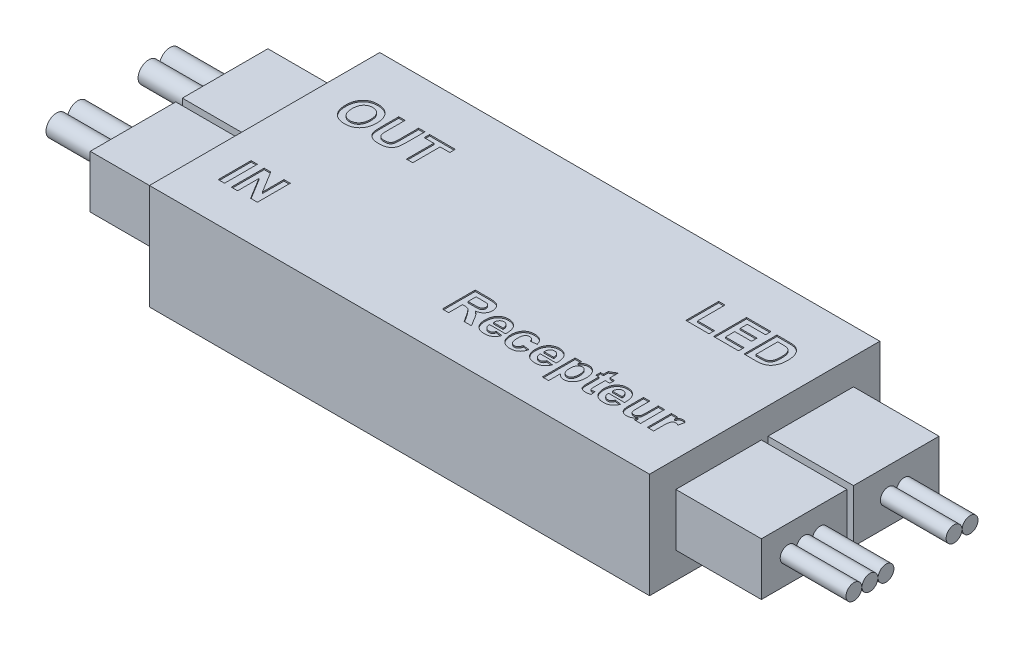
from build123d import *

# Parameters (mm, degrees)
ESQUISSE1_W             = 38
ESQUISSE1_H             = 17.5
BOSS_EXTRU_1_DEPTH      = 4
ESQUISSE2_W             = 6.5
ESQUISSE2_H             = 6.5
BOSS_EXTRU_2_DEPTH      = 2
ESQUISSE3_R             = 0.8
BOSS_EXTRU_3_DEPTH      = 5
ESQUISSE4_R             = 0.6
BOSS_EXTRU_4_DEPTH      = 5
ESQUISSE5_W             = 0.480769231
ESQUISSE5_H             = 2.5
ENL_V_MAT_EXTRU_1_DEPTH = 0.1
ESQUISSE6_W             = 0.48076923
ESQUISSE6_H             = 0.416666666
ESQUISSE6_H_2           = 1.826923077
ESQUISSE6_W_2           = 0.480769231
ESQUISSE6_H_3           = 2.5
ESQUISSE6_W_3           = 0.929487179
ESQUISSE6_H_4           = 0.416666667
ESQUISSE6_H_5           = 0.480769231
ENL_V_MAT_EXTRU_2_DEPTH = 0.1


with BuildPart() as part:
    # Esquisse1 → Boss.-Extru.1 (new, symmetric)
    with BuildSketch(Plane(origin=(0, 0, 0), x_dir=(1, 0, 0), z_dir=(0, 1, 0))):
        with Locations((19, 0)):
            Rectangle(ESQUISSE1_W, ESQUISSE1_H)
    extrude(amount=BOSS_EXTRU_1_DEPTH, both=True)

    # Esquisse2 → Boss.-Extru.2 (add, symmetric)
    with BuildSketch(Plane(origin=(0, 0, 0), x_dir=(1, 0, 0), z_dir=(0, 1, 0))):
        with Locations((-3.25, 3.5)):
            Rectangle(ESQUISSE2_W, ESQUISSE2_H)
        with Locations((-3.25, -3.5)):
            Rectangle(ESQUISSE2_W, ESQUISSE2_H)
        with Locations((41.25, -3.5)):
            Rectangle(ESQUISSE2_W, ESQUISSE2_H)
        with Locations((41.25, 3.5)):
            Rectangle(ESQUISSE2_W, ESQUISSE2_H)
    extrude(amount=BOSS_EXTRU_2_DEPTH, both=True)

    # Esquisse3 → Boss.-Extru.3 (add)
    with BuildSketch(Plane.ZY.offset(6.5)):
        with Locations(Location((-4.31, 0, 0), (0, 0, 180))):
            Circle(ESQUISSE3_R)
        with Locations(Location((-2.69, 0, 0), (0, 0, 180))):
            Circle(ESQUISSE3_R)
        with Locations(Location((2.69, 0, 0), (0, 0, 180))):
            Circle(ESQUISSE3_R)
        with Locations(Location((4.31, 0, 0), (0, 0, 180))):
            Circle(ESQUISSE3_R)
    extrude(amount=BOSS_EXTRU_3_DEPTH)

    # Esquisse4 → Boss.-Extru.4 (add)
    with BuildSketch(Plane(origin=(44.5, 0, 0), x_dir=(0, 0, -1), z_dir=(1, 0, 0))):
        with Locations(Location((-4.72, 0, 0), (0, 0, 180))):
            Circle(ESQUISSE4_R)
        with Locations(Location((-3.5, 0, 0), (0, 0, 180))):
            Circle(ESQUISSE4_R)
        with Locations(Location((-2.28, 0, 0), (0, 0, 180))):
            Circle(ESQUISSE4_R)
        with Locations(Location((2.89, 0, 0), (0, 0, 180))):
            Circle(ESQUISSE4_R)
        with Locations(Location((4.11, 0, 0), (0, 0, 180))):
            Circle(ESQUISSE4_R)
    extrude(amount=BOSS_EXTRU_4_DEPTH)

    # Esquisse5 → Enl_v. mat.-Extru.1 (cut)
    # profile 1 of 17: a face of its own
    with BuildSketch(Plane(origin=(0, 4, 0), x_dir=(1, 0, 0), z_dir=(0, 1, 0))):
        with BuildLine():
            add(Edge.make_bspline(
                [(2.16025641, 3.984975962), (2.160433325, 4.01586993), (2.160780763, 4.076541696), (2.166801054, 4.165549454), (2.174736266, 4.250866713), (2.187658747, 4.33215789), (2.202860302, 4.409803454), (2.221873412, 4.483780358), (2.244777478, 4.553829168), (2.262997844, 4.598554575), (2.271935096, 4.620492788)],
                knots=[0, 0, 0, 0, 1.141009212, 2.240794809, 3.294380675, 4.305229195, 5.280013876, 6.216333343, 7.125095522, 8, 8, 8, 8], degree=3))
            add(Edge.make_bspline(
                [(2.271935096, 4.620492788), (2.286544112, 4.6516805), (2.315590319, 4.713689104), (2.369533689, 4.801312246), (2.430675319, 4.883947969), (2.498511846, 4.961163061), (2.571311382, 5.031795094), (2.649417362, 5.092245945), (2.730054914, 5.144557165), (2.78740652, 5.1708666), (2.815805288, 5.183894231)],
                knots=[0, 0, 0, 0, 1.031372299, 2.050613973, 3.077158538, 4.108712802, 5.127684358, 6.111366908, 7.06480644, 8, 8, 8, 8], degree=3))
            add(Edge.make_bspline(
                [(2.815805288, 5.183894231), (2.835082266, 5.191801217), (2.874045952, 5.207783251), (2.934600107, 5.227729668), (2.997451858, 5.24393523), (3.062146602, 5.258421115), (3.129312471, 5.268409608), (3.198406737, 5.276784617), (3.269807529, 5.281174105), (3.31810393, 5.28175571), (3.342648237, 5.282051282)],
                knots=[0, 0, 0, 0, 0.92659354, 1.872881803, 2.832850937, 3.813025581, 4.820167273, 5.851730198, 6.908245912, 8, 8, 8, 8], degree=3))
            add(Edge.make_bspline(
                [(3.342648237, 5.282051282), (3.386596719, 5.280949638), (3.472604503, 5.278793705), (3.598237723, 5.263221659), (3.717124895, 5.236926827), (3.828863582, 5.198921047), (3.934417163, 5.151412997), (4.032965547, 5.092484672), (4.12465459, 5.022773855), (4.209307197, 4.943236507), (4.285542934, 4.854011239), (4.351937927, 4.75593155), (4.40763435, 4.649457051), (4.45350357, 4.534881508), (4.488750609, 4.411830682), (4.514216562, 4.280651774), (4.5293454, 4.141248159), (4.531133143, 4.045611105), (4.532051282, 3.996494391)],
                knots=[0, 0, 0, 0, 1.064641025, 2.083517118, 3.061799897, 4.009540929, 4.938075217, 5.861300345, 6.78508344, 7.723570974, 8.670267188, 9.622657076, 10.586935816, 11.576069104, 12.607749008, 13.683335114, 14.81022093, 16, 16, 16, 16], degree=3))
            add(Edge.make_bspline(
                [(4.532051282, 3.996494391), (4.531154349, 3.94770657), (4.529408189, 3.852725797), (4.513996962, 3.714416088), (4.48958679, 3.584193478), (4.453486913, 3.462355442), (4.408986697, 3.347972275), (4.352717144, 3.242406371), (4.287712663, 3.144257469), (4.211585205, 3.055993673), (4.128357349, 2.975999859), (4.036784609, 2.907103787), (3.938953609, 2.848095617), (3.833975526, 2.800450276), (3.72253459, 2.763227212), (3.604267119, 2.736730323), (3.479112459, 2.721218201), (3.393439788, 2.71905444), (3.349659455, 2.717948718)],
                knots=[0, 0, 0, 0, 1.18845052, 2.313691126, 3.386664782, 4.412527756, 5.405809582, 6.372003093, 7.321919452, 8.268293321, 9.206237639, 10.129603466, 11.054616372, 11.9847576, 12.932764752, 13.912672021, 14.933336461, 16, 16, 16, 16], degree=3))
            add(Edge.make_bspline(
                [(3.349659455, 2.717948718), (3.305379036, 2.719056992), (3.218709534, 2.721226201), (3.092219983, 2.736691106), (2.972778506, 2.763196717), (2.860470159, 2.800550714), (2.754528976, 2.847472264), (2.655933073, 2.905877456), (2.564627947, 2.97520986), (2.480704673, 3.054262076), (2.404624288, 3.142266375), (2.339712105, 3.239784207), (2.283439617, 3.344318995), (2.23870544, 3.457454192), (2.202804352, 3.57802578), (2.178334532, 3.706727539), (2.162893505, 3.843205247), (2.161151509, 3.936855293), (2.16025641, 3.984975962)],
                knots=[0, 0, 0, 0, 1.080878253, 2.11558926, 3.1052859, 4.062802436, 5.000434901, 5.928596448, 6.853693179, 7.793554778, 8.738606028, 9.68692032, 10.647726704, 11.63151566, 12.651483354, 13.714466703, 14.825613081, 16, 16, 16, 16], degree=3))
        make_face()
        with BuildLine():
            add(Edge.make_bspline(
                [(2.641025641, 4.001502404), (2.641505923, 3.966920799), (2.642435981, 3.899954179), (2.652342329, 3.802753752), (2.667376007, 3.711884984), (2.689485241, 3.627451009), (2.717416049, 3.549390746), (2.751637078, 3.477638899), (2.792006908, 3.4120886), (2.839569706, 3.354123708), (2.891028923, 3.302372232), (2.946574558, 3.257594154), (3.005171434, 3.219053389), (3.067833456, 3.188625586), (3.133256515, 3.164477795), (3.201948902, 3.146573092), (3.274252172, 3.136741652), (3.323589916, 3.135331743), (3.348657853, 3.134615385)],
                knots=[0, 0, 0, 0, 1.313550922, 2.543666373, 3.708465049, 4.810029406, 5.85539231, 6.85404609, 7.825601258, 8.772642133, 9.696587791, 10.59409323, 11.479048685, 12.35559886, 13.234601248, 14.125357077, 15.047515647, 16, 16, 16, 16], degree=3))
            add(Edge.make_bspline(
                [(3.348657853, 3.134615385), (3.373729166, 3.135317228), (3.423073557, 3.13669857), (3.495287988, 3.146731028), (3.564116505, 3.163868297), (3.629279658, 3.187892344), (3.69107445, 3.218803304), (3.749447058, 3.256480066), (3.804061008, 3.301461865), (3.855464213, 3.352461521), (3.901743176, 3.410811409), (3.941769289, 3.476350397), (3.975973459, 3.548537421), (4.003907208, 3.627399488), (4.025472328, 3.713084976), (4.039892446, 3.80563922), (4.049878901, 3.90479758), (4.050805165, 3.973263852), (4.051282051, 4.008513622)],
                knots=[0, 0, 0, 0, 0.949153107, 1.868086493, 2.754172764, 3.630100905, 4.492260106, 5.365378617, 6.254840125, 7.166615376, 8.102436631, 9.067266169, 10.06813181, 11.121736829, 12.23011542, 13.408501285, 14.665770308, 16, 16, 16, 16], degree=3))
            add(Edge.make_bspline(
                [(4.051282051, 4.008513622), (4.050743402, 4.043423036), (4.049700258, 4.111028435), (4.040615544, 4.208935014), (4.025736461, 4.300022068), (4.005052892, 4.384266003), (3.977718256, 4.461680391), (3.945070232, 4.532476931), (3.905594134, 4.59628575), (3.860319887, 4.653073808), (3.810221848, 4.703058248), (3.756151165, 4.746817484), (3.697800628, 4.783227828), (3.63573973, 4.813862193), (3.569322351, 4.836589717), (3.499223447, 4.853166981), (3.425244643, 4.863375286), (3.374565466, 4.864704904), (3.348657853, 4.865384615)],
                knots=[0, 0, 0, 0, 1.332337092, 2.580197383, 3.749299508, 4.852775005, 5.886662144, 6.878700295, 7.822989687, 8.743523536, 9.644687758, 10.519443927, 11.392806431, 12.264866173, 13.155606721, 14.065961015, 15.011303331, 16, 16, 16, 16], degree=3))
            add(Edge.make_bspline(
                [(3.348657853, 4.865384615), (3.322746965, 4.864715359), (3.272061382, 4.863406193), (3.197967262, 4.853028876), (3.127647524, 4.836945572), (3.061239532, 4.812920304), (2.998638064, 4.782580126), (2.940074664, 4.744952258), (2.885087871, 4.701267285), (2.834540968, 4.650524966), (2.788533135, 4.593239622), (2.749038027, 4.528651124), (2.71535977, 4.45746486), (2.687728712, 4.379470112), (2.667245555, 4.29445232), (2.651502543, 4.202982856), (2.642661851, 4.104508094), (2.641582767, 4.03657559), (2.641025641, 4.001502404)],
                knots=[0, 0, 0, 0, 0.981996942, 1.920933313, 2.83127778, 3.712125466, 4.592427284, 5.463259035, 6.34592384, 7.249932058, 8.173122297, 9.125107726, 10.113123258, 11.154048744, 12.256187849, 13.424658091, 14.670364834, 16, 16, 16, 16], degree=3))
        make_face(mode=Mode.SUBTRACT)
    # profile 2 of 17: a face of its own
    with BuildSketch(Plane(origin=(0, 4, 0), x_dir=(1, 0, 0), z_dir=(0, 1, 0))):
        with BuildLine():
            Line((4.948717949, 5.25), (5.429487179, 5.25))
            Line((5.429487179, 5.25), (5.429487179, 3.893329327))
            add(Edge.make_bspline(
                [(5.429487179, 3.893329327), (5.429670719, 3.867621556), (5.430021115, 3.818542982), (5.430262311, 3.748424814), (5.431597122, 3.685469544), (5.434491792, 3.62957573), (5.436478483, 3.580771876), (5.440167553, 3.539049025), (5.443847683, 3.504423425), (5.447425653, 3.483827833), (5.449018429, 3.474659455)],
                knots=[0, 0, 0, 0, 1.470600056, 2.807515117, 4.011048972, 5.072079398, 6.00911328, 6.804506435, 7.467811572, 8, 8, 8, 8], degree=3))
            add(Edge.make_bspline(
                [(5.449018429, 3.474659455), (5.455585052, 3.449942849), (5.468515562, 3.401272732), (5.504156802, 3.334741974), (5.551238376, 3.276099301), (5.599263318, 3.234277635), (5.642705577, 3.204679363), (5.679606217, 3.186665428), (5.718757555, 3.170244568), (5.76098727, 3.157644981), (5.805842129, 3.146619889), (5.853863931, 3.140245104), (5.904647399, 3.135352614), (5.939456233, 3.134865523), (5.957331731, 3.134615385)],
                knots=[0, 0, 0, 0, 1.376921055, 2.711331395, 4.038631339, 5.418057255, 6.132954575, 6.870556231, 7.630397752, 8.422890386, 9.247036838, 10.121396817, 11.035274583, 12, 12, 12, 12], degree=3))
            add(Edge.make_bspline(
                [(5.957331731, 3.134615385), (5.975366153, 3.134942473), (6.010478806, 3.135579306), (6.061363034, 3.139371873), (6.108837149, 3.14652714), (6.152872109, 3.155909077), (6.193700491, 3.167766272), (6.230996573, 3.182778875), (6.264701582, 3.200845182), (6.304304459, 3.22807557), (6.346917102, 3.266488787), (6.387926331, 3.318716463), (6.417276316, 3.376370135), (6.431042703, 3.429012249), (6.438118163, 3.474877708), (6.442428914, 3.515011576), (6.446371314, 3.56042919), (6.449951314, 3.61100615), (6.452399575, 3.666780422), (6.453723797, 3.727893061), (6.454765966, 3.794334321), (6.455004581, 3.840410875), (6.455128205, 3.864282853)],
                knots=[0, 0, 0, 0, 1.036876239, 2.018776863, 2.930845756, 3.794842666, 4.605604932, 5.371924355, 6.101864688, 6.799283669, 8.1310906, 9.382718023, 10.597336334, 11.822035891, 12.492591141, 13.265194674, 14.141890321, 15.11351293, 16.179860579, 17.351049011, 18.627594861, 20, 20, 20, 20], degree=3))
            Line((6.455128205, 3.864282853), (6.455128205, 5.25))
            Line((6.455128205, 5.25), (6.935897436, 5.25))
            Line((6.935897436, 5.25), (6.935897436, 3.942407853))
            add(Edge.make_bspline(
                [(6.935897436, 3.942407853), (6.935835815, 3.906349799), (6.935717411, 3.837065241), (6.933868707, 3.737382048), (6.929939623, 3.645926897), (6.926649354, 3.562543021), (6.920302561, 3.48744314), (6.913657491, 3.420580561), (6.905097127, 3.361966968), (6.892889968, 3.295344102), (6.872375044, 3.220597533), (6.839312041, 3.138030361), (6.797056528, 3.062911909), (6.745776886, 2.994953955), (6.685768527, 2.933886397), (6.616132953, 2.879949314), (6.537586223, 2.832486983), (6.465607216, 2.798311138), (6.402850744, 2.775298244), (6.351736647, 2.759724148), (6.297032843, 2.746754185), (6.23880349, 2.736461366), (6.177023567, 2.727782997), (6.111670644, 2.721987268), (6.042843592, 2.718370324), (5.995898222, 2.718091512), (5.971854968, 2.717948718)],
                knots=[0, 0, 0, 0, 1.415574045, 2.719986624, 3.913607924, 5.00929969, 5.995467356, 6.871900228, 7.64671288, 8.320227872, 9.530145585, 10.682614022, 11.803571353, 12.90325401, 14.015460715, 15.154679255, 16.351678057, 17.612271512, 18.275764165, 18.974412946, 19.708786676, 20.481351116, 21.295095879, 22.157200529, 23.056203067, 24, 24, 24, 24], degree=3))
            add(Edge.make_bspline(
                [(5.971854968, 2.717948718), (5.942973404, 2.718317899), (5.887025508, 2.719033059), (5.805812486, 2.722223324), (5.730142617, 2.728808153), (5.659778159, 2.737708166), (5.594748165, 2.749149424), (5.534888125, 2.762827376), (5.480675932, 2.780114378), (5.416104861, 2.804804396), (5.34412963, 2.842571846), (5.265781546, 2.892953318), (5.197005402, 2.949817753), (5.138405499, 3.012609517), (5.089418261, 3.079121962), (5.049600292, 3.147915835), (5.017691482, 3.217844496), (5.00435817, 3.266446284), (4.997796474, 3.290364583)],
                knots=[0, 0, 0, 0, 1.128613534, 2.186292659, 3.174878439, 4.095586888, 4.95671962, 5.754129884, 6.492676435, 7.178284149, 8.453103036, 9.659838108, 10.813193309, 11.929983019, 13.007587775, 14.033493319, 15.032227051, 16, 16, 16, 16], degree=3))
            add(Edge.make_bspline(
                [(4.997796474, 3.290364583), (4.993780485, 3.309195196), (4.985321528, 3.348858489), (4.975714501, 3.411915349), (4.966950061, 3.481351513), (4.960963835, 3.557249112), (4.95528944, 3.639367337), (4.951215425, 3.727861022), (4.949540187, 3.822710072), (4.94899755, 3.888154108), (4.948717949, 3.921875)],
                knots=[0, 0, 0, 0, 0.728071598, 1.533551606, 2.411422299, 3.374601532, 4.412367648, 5.524718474, 6.72457895, 8, 8, 8, 8], degree=3))
            Line((4.948717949, 3.921875), (4.948717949, 5.25))
        make_face()
    # profile 3 of 17: a face of its own
    with BuildSketch(Plane(origin=(0, 4, 0), x_dir=(1, 0, 0), z_dir=(0, 1, 0))):
        Polygon((8.025641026, 2.75), (8.025641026, 4.833333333), (7.288461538, 4.833333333), (7.288461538, 5.25), (9.243589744, 5.25), (9.243589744, 4.833333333), (8.506410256, 4.833333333), (8.506410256, 2.75), align=None)
    # profile 4 of 17: a face of its own
    with BuildSketch(Plane(origin=(0, 4, 0), x_dir=(1, 0, 0), z_dir=(0, 1, 0))):
        Polygon((29.256410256, 2.75), (29.256410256, 5.25), (29.737179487, 5.25), (29.737179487, 3.166666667), (31.019230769, 3.166666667), (31.019230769, 2.75), align=None)
    # profile 5 of 17: a face of its own
    with BuildSketch(Plane(origin=(0, 4, 0), x_dir=(1, 0, 0), z_dir=(0, 1, 0))):
        Polygon((31.371794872, 2.75), (31.371794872, 5.25), (33.230769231, 5.25), (33.230769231, 4.833333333), (31.852564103, 4.833333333), (31.852564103, 4.288461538), (33.134615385, 4.288461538), (33.134615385, 3.871794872), (31.852564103, 3.871794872), (31.852564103, 3.166666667), (33.262820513, 3.166666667), (33.262820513, 2.75), align=None)
    # profile 6 of 17: a face of its own
    with BuildSketch(Plane(origin=(0, 4, 0), x_dir=(1, 0, 0), z_dir=(0, 1, 0))):
        with BuildLine():
            Line((33.679487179, 5.25), (34.596454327, 5.25))
            add(Edge.make_bspline(
                [(34.596454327, 5.25), (34.621498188, 5.250012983), (34.670264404, 5.250038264), (34.741036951, 5.247102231), (34.80721838, 5.244148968), (34.868618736, 5.238237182), (34.925451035, 5.232040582), (34.97781726, 5.22419522), (35.025386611, 5.21414053), (35.055383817, 5.206211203), (35.069711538, 5.202423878)],
                knots=[0, 0, 0, 0, 1.259756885, 2.453039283, 3.563158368, 4.591894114, 5.55549294, 6.43918076, 7.254497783, 8, 8, 8, 8], degree=3))
            add(Edge.make_bspline(
                [(35.069711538, 5.202423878), (35.08762923, 5.196584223), (35.123141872, 5.185010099), (35.175204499, 5.164730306), (35.224531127, 5.139579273), (35.272951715, 5.113140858), (35.318304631, 5.081880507), (35.362990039, 5.049358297), (35.404107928, 5.011684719), (35.458028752, 4.959033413), (35.51955651, 4.885688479), (35.584016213, 4.788400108), (35.638574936, 4.681612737), (35.675851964, 4.585934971), (35.701022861, 4.504600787), (35.717476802, 4.439391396), (35.731453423, 4.370701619), (35.742928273, 4.298514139), (35.751843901, 4.222828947), (35.75848168, 4.143666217), (35.761714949, 4.060957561), (35.762447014, 4.004676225), (35.762820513, 3.975961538)],
                knots=[0, 0, 0, 0, 0.745524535, 1.477620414, 2.207090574, 2.934465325, 3.657932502, 4.384347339, 5.118673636, 5.861150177, 7.365375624, 8.894729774, 10.468936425, 12.099947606, 12.950091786, 13.83580991, 14.759228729, 15.722225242, 16.726454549, 17.773376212, 18.863978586, 20, 20, 20, 20], degree=3))
            add(Edge.make_bspline(
                [(35.762820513, 3.975961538), (35.762138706, 3.926333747), (35.760820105, 3.830354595), (35.745544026, 3.691857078), (35.723529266, 3.563218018), (35.698714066, 3.482967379), (35.686698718, 3.444110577)],
                knots=[0, 0, 0, 0, 1.103207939, 2.133582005, 3.096293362, 4, 4, 4, 4], degree=3))
            add(Edge.make_bspline(
                [(35.686698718, 3.444110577), (35.678764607, 3.421813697), (35.663156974, 3.377952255), (35.635844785, 3.31468191), (35.606333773, 3.254470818), (35.574379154, 3.19736642), (35.539819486, 3.143625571), (35.502525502, 3.093409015), (35.463075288, 3.046055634), (35.434495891, 3.016909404), (35.420272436, 3.002403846)],
                knots=[0, 0, 0, 0, 1.090884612, 2.145940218, 3.175104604, 4.181306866, 5.161203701, 6.118658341, 7.063689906, 8, 8, 8, 8], degree=3))
            add(Edge.make_bspline(
                [(35.420272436, 3.002403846), (35.397255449, 2.981704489), (35.349791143, 2.939019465), (35.266150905, 2.886195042), (35.171613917, 2.839517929), (35.10323164, 2.815540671), (35.067708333, 2.803084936)],
                knots=[0, 0, 0, 0, 0.908140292, 1.872714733, 2.8949153, 4, 4, 4, 4], degree=3))
            add(Edge.make_bspline(
                [(35.067708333, 2.803084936), (35.053408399, 2.798693), (35.023729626, 2.789577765), (34.976671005, 2.779842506), (34.926434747, 2.769586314), (34.872441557, 2.763407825), (34.815251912, 2.756892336), (34.754410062, 2.753234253), (34.690126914, 2.750637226), (34.646036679, 2.750215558), (34.623497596, 2.75)],
                knots=[0, 0, 0, 0, 0.799129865, 1.658552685, 2.566799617, 3.538529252, 4.561352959, 5.643373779, 6.795284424, 8, 8, 8, 8], degree=3))
            Line((34.623497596, 2.75), (33.679487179, 2.75))
            Line((33.679487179, 2.75), (33.679487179, 5.25))
        make_face()
        with BuildLine():
            Line((34.16025641, 4.833333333), (34.16025641, 3.166666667))
            Line((34.16025641, 3.166666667), (34.555889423, 3.166666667))
            add(Edge.make_bspline(
                [(34.555889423, 3.166666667), (34.573751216, 3.166808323), (34.608141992, 3.167081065), (34.657906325, 3.167882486), (34.703639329, 3.170052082), (34.74558058, 3.172299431), (34.78362089, 3.176012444), (34.817925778, 3.179664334), (34.848304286, 3.184773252), (34.867066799, 3.188806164), (34.875901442, 3.190705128)],
                knots=[0, 0, 0, 0, 1.333384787, 2.567275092, 3.714769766, 4.750907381, 5.701951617, 6.567520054, 7.325492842, 8, 8, 8, 8], degree=3))
            add(Edge.make_bspline(
                [(34.875901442, 3.190705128), (34.896593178, 3.19622671), (34.936895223, 3.206981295), (34.993483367, 3.230956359), (35.044688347, 3.259879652), (35.09136769, 3.294658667), (35.13343544, 3.338611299), (35.169345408, 3.394823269), (35.202579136, 3.461863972), (35.225337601, 3.526038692), (35.241673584, 3.583358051), (35.252731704, 3.631467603), (35.261470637, 3.683517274), (35.268987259, 3.739301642), (35.275060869, 3.798748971), (35.278840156, 3.862073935), (35.281419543, 3.92919902), (35.281836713, 3.975291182), (35.282051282, 3.998998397)],
                knots=[0, 0, 0, 0, 1.038686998, 2.023088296, 2.974059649, 3.888265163, 4.839857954, 5.909819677, 7.113156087, 8.466843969, 9.20827164, 10.006482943, 10.861893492, 11.769681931, 12.739021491, 13.762258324, 14.849031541, 16, 16, 16, 16], degree=3))
            add(Edge.make_bspline(
                [(35.282051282, 3.998998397), (35.281838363, 4.022705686), (35.2814259, 4.068631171), (35.278850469, 4.135255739), (35.27509241, 4.197583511), (35.268975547, 4.255691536), (35.261575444, 4.309660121), (35.252734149, 4.359534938), (35.241742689, 4.404988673), (35.225392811, 4.458988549), (35.200607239, 4.519686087), (35.166878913, 4.586049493), (35.125459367, 4.642612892), (35.079694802, 4.691750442), (35.026927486, 4.732188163), (34.968514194, 4.766057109), (34.903183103, 4.792344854), (34.856711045, 4.803541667), (34.832832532, 4.809294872)],
                knots=[0, 0, 0, 0, 1.117996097, 2.165769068, 3.143980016, 4.062055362, 4.920439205, 5.712587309, 6.449616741, 7.124491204, 8.371470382, 9.537068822, 10.625202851, 11.666538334, 12.693249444, 13.747832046, 14.842779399, 16, 16, 16, 16], degree=3))
            add(Edge.make_bspline(
                [(34.832832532, 4.809294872), (34.822496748, 4.811215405), (34.799741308, 4.815443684), (34.761980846, 4.820382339), (34.717679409, 4.824047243), (34.666611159, 4.827788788), (34.608982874, 4.829924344), (34.544553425, 4.832153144), (34.473592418, 4.832914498), (34.424011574, 4.83318971), (34.398137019, 4.833333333)],
                knots=[0, 0, 0, 0, 0.578738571, 1.274160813, 2.095454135, 3.025967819, 4.093109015, 5.270126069, 6.575371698, 8, 8, 8, 8], degree=3))
            Line((34.398137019, 4.833333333), (34.16025641, 4.833333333))
        make_face(mode=Mode.SUBTRACT)
    # profile 7 of 17: a face of its own
    with BuildSketch(Plane(origin=(0, 4, 0), x_dir=(1, 0, 0), z_dir=(0, 1, 0))):
        with Locations((2.46474359, -4.5)):
            Rectangle(ESQUISSE5_W, ESQUISSE5_H)
    # profile 8 of 17: a face of its own
    with BuildSketch(Plane(origin=(0, 4, 0), x_dir=(1, 0, 0), z_dir=(0, 1, 0))):
        Polygon((3.217948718, -5.75), (3.217948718, -3.25), (3.720252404, -3.25), (4.724358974, -4.893629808), (4.724358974, -3.25), (5.205128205, -3.25), (5.205128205, -5.75), (4.687299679, -5.75), (3.698717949, -4.132411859), (3.698717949, -5.75), align=None)
    # profile 9 of 17: a face of its own
    with BuildSketch(Plane(origin=(0, 4, 0), x_dir=(1, 0, 0), z_dir=(0, 1, 0))):
        with BuildLine():
            Line((19.256410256, -5.75), (19.256410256, -3.25))
            Line((19.256410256, -3.25), (20.305588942, -3.25))
            add(Edge.make_bspline(
                [(20.305588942, -3.25), (20.33747452, -3.25019651), (20.398923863, -3.250575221), (20.487791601, -3.253336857), (20.569747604, -3.259122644), (20.64515543, -3.265675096), (20.713652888, -3.275208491), (20.775510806, -3.286629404), (20.830625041, -3.299864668), (20.879799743, -3.315716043), (20.924637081, -3.333858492), (20.966405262, -3.355453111), (21.005563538, -3.380753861), (21.042713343, -3.408888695), (21.078011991, -3.439900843), (21.110491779, -3.47461104), (21.140718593, -3.51250244), (21.168668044, -3.553259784), (21.19328976, -3.596703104), (21.215787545, -3.641437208), (21.23410159, -3.687938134), (21.249228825, -3.735986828), (21.261312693, -3.78547897), (21.269699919, -3.836540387), (21.274935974, -3.889078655), (21.275403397, -3.924566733), (21.275641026, -3.942608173)],
                knots=[0, 0, 0, 0, 1.675828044, 3.229627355, 4.67171229, 5.993455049, 7.206927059, 8.304770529, 9.29850117, 10.183580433, 11.017754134, 11.837875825, 12.650738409, 13.464925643, 14.285328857, 15.117007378, 15.959673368, 16.830859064, 17.711229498, 18.58228265, 19.460420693, 20.334473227, 21.228207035, 22.135446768, 23.052097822, 24, 24, 24, 24], degree=3))
            add(Edge.make_bspline(
                [(21.275641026, -3.942608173), (21.27520026, -3.965335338), (21.274338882, -4.009750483), (21.266412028, -4.074849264), (21.254638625, -4.137046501), (21.23785573, -4.196428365), (21.214779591, -4.252296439), (21.187991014, -4.305433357), (21.156041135, -4.355658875), (21.119147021, -4.402475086), (21.077341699, -4.445923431), (21.030441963, -4.485109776), (20.978782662, -4.520187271), (20.92205129, -4.550953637), (20.860642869, -4.577255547), (20.794291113, -4.599385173), (20.723296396, -4.617396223), (20.67391251, -4.62587096), (20.648637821, -4.630208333)],
                knots=[0, 0, 0, 0, 1.05911256, 2.069797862, 3.05271628, 4.008392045, 4.940519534, 5.866323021, 6.779546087, 7.71056835, 8.640711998, 9.585328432, 10.554502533, 11.547017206, 12.589327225, 13.664782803, 14.804835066, 16, 16, 16, 16], degree=3))
            add(Edge.make_bspline(
                [(20.648637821, -4.630208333), (20.673081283, -4.646397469), (20.72092047, -4.678081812), (20.787109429, -4.730266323), (20.84653141, -4.785038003), (20.891522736, -4.833744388), (20.926093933, -4.876576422), (20.953929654, -4.914037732), (20.983954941, -4.957150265), (21.015875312, -5.005937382), (21.050634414, -5.059967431), (21.086939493, -5.120067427), (21.125550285, -5.185651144), (21.151509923, -5.231464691), (21.164963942, -5.255208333)],
                knots=[0, 0, 0, 0, 1.285445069, 2.515791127, 3.691898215, 4.826622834, 5.420063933, 6.105349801, 6.873086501, 7.723915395, 8.66222816, 9.690593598, 10.803111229, 12, 12, 12, 12], degree=3))
            Line((21.164963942, -5.255208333), (21.467948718, -5.75))
            Line((21.467948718, -5.75), (20.906049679, -5.75))
            Line((20.906049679, -5.75), (20.550480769, -5.182592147))
            add(Edge.make_bspline(
                [(20.550480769, -5.182592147), (20.534150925, -5.159867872), (20.502973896, -5.11648256), (20.457967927, -5.054830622), (20.41679146, -4.999949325), (20.380540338, -4.951043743), (20.34738027, -4.909500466), (20.318318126, -4.874595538), (20.293945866, -4.84557995), (20.266368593, -4.816809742), (20.234285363, -4.787241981), (20.194568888, -4.758574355), (20.153783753, -4.735720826), (20.110085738, -4.718283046), (20.059550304, -4.706124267), (19.99879871, -4.698377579), (19.925920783, -4.69266216), (19.873244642, -4.692431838), (19.844851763, -4.692307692)],
                knots=[0, 0, 0, 0, 1.465447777, 2.797841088, 3.997266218, 5.05856206, 5.985598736, 6.780315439, 7.437430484, 7.969193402, 8.866571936, 9.718200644, 10.52825214, 11.309096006, 12.174169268, 13.242355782, 14.513606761, 16, 16, 16, 16], degree=3))
            Line((19.844851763, -4.692307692), (19.737179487, -4.692307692))
            Line((19.737179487, -4.692307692), (19.737179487, -5.75))
            Line((19.737179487, -5.75), (19.256410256, -5.75))
        make_face()
        with BuildLine():
            Line((19.737179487, -4.275641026), (20.124298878, -4.275641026))
            add(Edge.make_bspline(
                [(20.124298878, -4.275641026), (20.154181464, -4.275576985), (20.21111284, -4.275454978), (20.292070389, -4.27368775), (20.36439274, -4.272187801), (20.427647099, -4.268419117), (20.482116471, -4.264683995), (20.527582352, -4.259829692), (20.564427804, -4.254092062), (20.601230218, -4.245171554), (20.638928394, -4.22962933), (20.679107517, -4.207492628), (20.713447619, -4.178775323), (20.743194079, -4.145575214), (20.765886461, -4.106545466), (20.783659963, -4.063424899), (20.792671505, -4.015255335), (20.794122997, -3.981867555), (20.794871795, -3.964643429)],
                knots=[0, 0, 0, 0, 1.697953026, 3.23488743, 4.60134403, 5.807846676, 6.835100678, 7.703488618, 8.405232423, 8.952775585, 9.851109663, 10.713519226, 11.549115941, 12.382556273, 13.233359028, 14.101746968, 15.020727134, 16, 16, 16, 16], degree=3))
            add(Edge.make_bspline(
                [(20.794871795, -3.964643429), (20.794020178, -3.945374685), (20.792377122, -3.908198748), (20.779419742, -3.855297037), (20.756803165, -3.808565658), (20.72574202, -3.767927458), (20.686749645, -3.733611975), (20.640305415, -3.706372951), (20.586754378, -3.686086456), (20.548129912, -3.678594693), (20.527944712, -3.674679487)],
                knots=[0, 0, 0, 0, 1.062977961, 2.050844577, 2.982300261, 3.90936959, 4.856017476, 5.831122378, 6.86654153, 8, 8, 8, 8], degree=3))
            add(Edge.make_bspline(
                [(20.527944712, -3.674679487), (20.521272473, -3.673946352), (20.505457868, -3.672208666), (20.477531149, -3.671092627), (20.441823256, -3.669377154), (20.397901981, -3.668676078), (20.346159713, -3.667447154), (20.286390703, -3.667221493), (20.218784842, -3.66650052), (20.17104062, -3.666609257), (20.145833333, -3.666666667)],
                knots=[0, 0, 0, 0, 0.42127143, 0.998501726, 1.753681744, 2.66564073, 3.755712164, 5.002818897, 6.417592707, 8, 8, 8, 8], degree=3))
            Line((20.145833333, -3.666666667), (19.737179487, -3.666666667))
            Line((19.737179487, -3.666666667), (19.737179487, -4.275641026))
        make_face(mode=Mode.SUBTRACT)
    # profile 10 of 17: a face of its own
    with BuildSketch(Plane(origin=(0, 4, 0), x_dir=(1, 0, 0), z_dir=(0, 1, 0))):
        with BuildLine():
            Line((22.782051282, -5.173076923), (23.262820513, -5.237179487))
            add(Edge.make_bspline(
                [(23.262820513, -5.237179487), (23.25495686, -5.258840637), (23.239495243, -5.301431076), (23.211246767, -5.362159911), (23.179670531, -5.41883895), (23.144918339, -5.471771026), (23.107119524, -5.5210252), (23.065024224, -5.565565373), (23.020683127, -5.607049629), (22.972241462, -5.64350262), (22.920913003, -5.676285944), (22.866439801, -5.704971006), (22.808386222, -5.728332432), (22.747631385, -5.747896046), (22.683899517, -5.763511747), (22.616930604, -5.774428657), (22.546810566, -5.78106145), (22.498946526, -5.78171718), (22.474559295, -5.782051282)],
                knots=[0, 0, 0, 0, 1.071172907, 2.106154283, 3.1104349, 4.085737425, 5.048416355, 5.993087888, 6.932482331, 7.868664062, 8.80754521, 9.762367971, 10.726735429, 11.713584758, 12.728370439, 13.774815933, 14.866245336, 16, 16, 16, 16], degree=3))
            add(Edge.make_bspline(
                [(22.474559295, -5.782051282), (22.436450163, -5.781110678), (22.362445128, -5.779284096), (22.25537704, -5.764605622), (22.15593355, -5.740707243), (22.063923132, -5.70723291), (21.979651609, -5.663322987), (21.902992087, -5.609929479), (21.833794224, -5.546936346), (21.795008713, -5.498164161), (21.775440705, -5.473557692)],
                knots=[0, 0, 0, 0, 1.150944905, 2.235047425, 3.25761485, 4.235688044, 5.185329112, 6.119879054, 7.051444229, 8, 8, 8, 8], degree=3))
            add(Edge.make_bspline(
                [(21.775440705, -5.473557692), (21.760999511, -5.452617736), (21.731919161, -5.410450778), (21.695771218, -5.342125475), (21.664861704, -5.269947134), (21.640237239, -5.193709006), (21.619767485, -5.113700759), (21.605995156, -5.029414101), (21.598057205, -4.941025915), (21.596796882, -4.880792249), (21.596153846, -4.850060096)],
                knots=[0, 0, 0, 0, 0.92479112, 1.862259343, 2.806490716, 3.778329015, 4.774107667, 5.808532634, 6.881879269, 8, 8, 8, 8], degree=3))
            add(Edge.make_bspline(
                [(21.596153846, -4.850060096), (21.596682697, -4.813629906), (21.597716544, -4.742412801), (21.609956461, -4.638887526), (21.627227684, -4.540990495), (21.653567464, -4.449738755), (21.686488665, -4.364091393), (21.727806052, -4.285149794), (21.775464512, -4.211478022), (21.831188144, -4.145301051), (21.892254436, -4.085797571), (21.957240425, -4.033365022), (22.026632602, -3.98956997), (22.09939739, -3.953016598), (22.176745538, -3.925655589), (22.257708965, -3.905514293), (22.342641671, -3.893248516), (22.400567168, -3.891774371), (22.429987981, -3.891025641)],
                knots=[0, 0, 0, 0, 1.222152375, 2.389176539, 3.494777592, 4.555389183, 5.572001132, 6.56945427, 7.540785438, 8.511469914, 9.46642023, 10.399267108, 11.30862844, 12.215760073, 13.126777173, 14.056336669, 15.012798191, 16, 16, 16, 16], degree=3))
            add(Edge.make_bspline(
                [(22.429987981, -3.891025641), (22.462915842, -3.891721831), (22.527352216, -3.893084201), (22.621300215, -3.905874), (22.710003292, -3.92667691), (22.793171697, -3.956569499), (22.871347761, -3.994053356), (22.943950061, -4.040507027), (23.010982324, -4.095506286), (23.072279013, -4.159027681), (23.127753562, -4.230653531), (23.174971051, -4.311765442), (23.214498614, -4.401525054), (23.246544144, -4.50016378), (23.27023503, -4.607888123), (23.286445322, -4.72441774), (23.295689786, -4.849741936), (23.295150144, -4.936182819), (23.294871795, -4.980769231)],
                knots=[0, 0, 0, 0, 0.994942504, 1.946998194, 2.860087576, 3.744358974, 4.613292, 5.475605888, 6.343365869, 7.228414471, 8.138836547, 9.075277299, 10.058013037, 11.098483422, 12.205225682, 13.387753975, 14.652597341, 16, 16, 16, 16], degree=3))
            Line((23.294871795, -4.980769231), (22.076923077, -4.980769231))
            add(Edge.make_bspline(
                [(22.076923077, -4.980769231), (22.077711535, -4.997977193), (22.079246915, -5.031486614), (22.085062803, -5.080468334), (22.095131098, -5.126317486), (22.108307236, -5.169312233), (22.123974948, -5.209482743), (22.143905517, -5.246443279), (22.166868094, -5.28066536), (22.193414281, -5.311590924), (22.22248019, -5.339043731), (22.253151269, -5.363169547), (22.28538044, -5.384265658), (22.320000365, -5.400310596), (22.355860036, -5.413858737), (22.393604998, -5.4225429), (22.432982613, -5.428313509), (22.459847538, -5.429090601), (22.473557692, -5.429487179)],
                knots=[0, 0, 0, 0, 1.231756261, 2.398624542, 3.522625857, 4.583815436, 5.612473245, 6.600564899, 7.580690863, 8.554470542, 9.508734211, 10.435415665, 11.342824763, 12.255949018, 13.158633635, 14.07945191, 15.019874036, 16, 16, 16, 16], degree=3))
            add(Edge.make_bspline(
                [(22.473557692, -5.429487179), (22.491805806, -5.42867805), (22.527149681, -5.427110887), (22.578095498, -5.41613058), (22.624320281, -5.396780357), (22.666308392, -5.36980385), (22.703669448, -5.333979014), (22.734992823, -5.288348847), (22.762379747, -5.234337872), (22.775278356, -5.194169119), (22.782051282, -5.173076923)],
                knots=[0, 0, 0, 0, 1.004430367, 1.945431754, 2.851730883, 3.749038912, 4.678525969, 5.68064125, 6.782128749, 8, 8, 8, 8], degree=3))
        make_face()
        with BuildLine():
            add(Edge.make_bspline(
                [(22.814102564, -4.692307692), (22.81327513, -4.674602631), (22.811663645, -4.640120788), (22.806407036, -4.589846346), (22.79738322, -4.542986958), (22.785514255, -4.499289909), (22.769677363, -4.459293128), (22.751996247, -4.421850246), (22.730312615, -4.388127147), (22.705473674, -4.358201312), (22.67927246, -4.330848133), (22.650309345, -4.308102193), (22.621024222, -4.287746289), (22.589902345, -4.271458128), (22.557266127, -4.259013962), (22.523225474, -4.249864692), (22.487720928, -4.244962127), (22.463722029, -4.244052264), (22.451522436, -4.243589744)],
                knots=[0, 0, 0, 0, 1.317025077, 2.564998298, 3.752245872, 4.859831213, 5.924126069, 6.944952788, 7.932526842, 8.893486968, 9.832088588, 10.740700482, 11.624936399, 12.479435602, 13.343337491, 14.21592381, 15.09308328, 16, 16, 16, 16], degree=3))
            add(Edge.make_bspline(
                [(22.451522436, -4.243589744), (22.438485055, -4.244012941), (22.412794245, -4.244846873), (22.375119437, -4.250288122), (22.339409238, -4.259939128), (22.305391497, -4.273001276), (22.273139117, -4.290202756), (22.242651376, -4.31129825), (22.213813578, -4.336023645), (22.196437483, -4.354755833), (22.18760016, -4.364282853)],
                knots=[0, 0, 0, 0, 1.043516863, 2.056302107, 3.038302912, 3.998520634, 4.966791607, 5.956307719, 6.960596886, 8, 8, 8, 8], degree=3))
            add(Edge.make_bspline(
                [(22.18760016, -4.364282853), (22.179363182, -4.3746401), (22.162814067, -4.3954491), (22.141824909, -4.429951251), (22.123541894, -4.46683001), (22.109917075, -4.507081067), (22.09795172, -4.549399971), (22.090932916, -4.594798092), (22.086204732, -4.642625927), (22.085697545, -4.675434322), (22.085436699, -4.692307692)],
                knots=[0, 0, 0, 0, 0.903873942, 1.815995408, 2.755131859, 3.711650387, 4.716574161, 5.757841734, 6.846857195, 8, 8, 8, 8], degree=3))
            Line((22.085436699, -4.692307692), (22.814102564, -4.692307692))
        make_face(mode=Mode.SUBTRACT)
    # profile 11 of 17: a face of its own
    with BuildSketch(Plane(origin=(0, 4, 0), x_dir=(1, 0, 0), z_dir=(0, 1, 0))):
        with BuildLine():
            Line((25.185897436, -4.467948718), (24.705128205, -4.532051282))
            add(Edge.make_bspline(
                [(24.705128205, -4.532051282), (24.700709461, -4.509536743), (24.692279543, -4.466584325), (24.670905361, -4.407102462), (24.641672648, -4.35654613), (24.605114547, -4.315241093), (24.562082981, -4.283053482), (24.513206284, -4.259581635), (24.457960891, -4.245928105), (24.419248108, -4.244389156), (24.399138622, -4.243589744)],
                knots=[0, 0, 0, 0, 1.183520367, 2.2578771, 3.246797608, 4.180863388, 5.085846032, 6.003342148, 6.962829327, 8, 8, 8, 8], degree=3))
            add(Edge.make_bspline(
                [(24.399138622, -4.243589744), (24.385431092, -4.243966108), (24.358711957, -4.24469973), (24.319628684, -4.250679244), (24.283016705, -4.261519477), (24.247939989, -4.275316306), (24.215551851, -4.294108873), (24.184892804, -4.31632171), (24.156922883, -4.343182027), (24.130702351, -4.373882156), (24.106593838, -4.409287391), (24.087057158, -4.45072255), (24.069926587, -4.497128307), (24.056004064, -4.549108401), (24.045270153, -4.606552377), (24.037191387, -4.66940784), (24.032874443, -4.737652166), (24.032332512, -4.784950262), (24.032051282, -4.809495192)],
                knots=[0, 0, 0, 0, 0.862078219, 1.680389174, 2.478024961, 3.259954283, 4.04533088, 4.826625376, 5.636266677, 6.477958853, 7.363321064, 8.321359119, 9.351280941, 10.472100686, 11.701575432, 13.024867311, 14.456081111, 16, 16, 16, 16], degree=3))
            add(Edge.make_bspline(
                [(24.032051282, -4.809495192), (24.032267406, -4.836714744), (24.032684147, -4.889200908), (24.037875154, -4.964897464), (24.045611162, -5.034298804), (24.056512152, -5.097595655), (24.070833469, -5.154565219), (24.088394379, -5.205504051), (24.108484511, -5.250583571), (24.133135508, -5.288952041), (24.159550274, -5.322520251), (24.18929418, -5.350523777), (24.22000607, -5.375693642), (24.254140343, -5.394937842), (24.289664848, -5.411019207), (24.32796879, -5.421018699), (24.367948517, -5.428713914), (24.395592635, -5.429226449), (24.409655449, -5.429487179)],
                knots=[0, 0, 0, 0, 1.594318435, 3.074248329, 4.44256617, 5.683784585, 6.834147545, 7.879495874, 8.83778105, 9.716843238, 10.544636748, 11.333080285, 12.105903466, 12.864046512, 13.621684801, 14.38335177, 15.177596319, 16, 16, 16, 16], degree=3))
            add(Edge.make_bspline(
                [(24.409655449, -5.429487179), (24.430289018, -5.428600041), (24.470309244, -5.426879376), (24.527137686, -5.411462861), (24.57818251, -5.3864972), (24.615197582, -5.357144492), (24.642078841, -5.328876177), (24.659588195, -5.302837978), (24.677202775, -5.274349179), (24.691656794, -5.24138278), (24.706051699, -5.205513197), (24.717567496, -5.165603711), (24.729005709, -5.122666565), (24.734396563, -5.092497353), (24.737179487, -5.076923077)],
                knots=[0, 0, 0, 0, 1.391704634, 2.699306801, 3.945045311, 5.206156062, 5.868460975, 6.572467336, 7.320954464, 8.128297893, 8.999513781, 9.930638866, 10.931732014, 12, 12, 12, 12], degree=3))
            Line((24.737179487, -5.076923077), (25.217948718, -5.141025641))
            add(Edge.make_bspline(
                [(25.217948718, -5.141025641), (25.211619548, -5.166663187), (25.199215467, -5.216908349), (25.17510698, -5.289061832), (25.146966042, -5.356502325), (25.115119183, -5.419420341), (25.078376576, -5.477136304), (25.037757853, -5.530048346), (24.992817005, -5.577843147), (24.944132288, -5.62126967), (24.890944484, -5.659432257), (24.833172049, -5.692023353), (24.771659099, -5.720293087), (24.70539201, -5.742551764), (24.635194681, -5.760893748), (24.560400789, -5.772974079), (24.481435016, -5.780731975), (24.427369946, -5.781604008), (24.399639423, -5.782051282)],
                knots=[0, 0, 0, 0, 1.110268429, 2.175934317, 3.195555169, 4.181481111, 5.137790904, 6.068820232, 6.982751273, 7.892872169, 8.808581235, 9.729898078, 10.678730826, 11.651191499, 12.666063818, 13.726769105, 14.834036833, 16, 16, 16, 16], degree=3))
            add(Edge.make_bspline(
                [(24.399639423, -5.782051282), (24.368052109, -5.78128504), (24.306495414, -5.779791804), (24.216594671, -5.768059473), (24.131603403, -5.74877287), (24.051503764, -5.720869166), (23.975956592, -5.68607635), (23.905738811, -5.642378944), (23.840468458, -5.591106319), (23.780297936, -5.532406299), (23.726147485, -5.466917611), (23.67940162, -5.394683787), (23.639736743, -5.316606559), (23.607049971, -5.23260669), (23.582119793, -5.142284), (23.564424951, -5.046096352), (23.553008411, -4.943983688), (23.551867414, -4.873963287), (23.551282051, -4.838040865)],
                knots=[0, 0, 0, 0, 1.056003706, 2.057917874, 3.026125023, 3.965316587, 4.889355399, 5.801804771, 6.724223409, 7.659808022, 8.607570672, 9.559810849, 10.530974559, 11.531347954, 12.568834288, 13.659317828, 14.799164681, 16, 16, 16, 16], degree=3))
            add(Edge.make_bspline(
                [(23.551282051, -4.838040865), (23.551868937, -4.801784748), (23.553013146, -4.731098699), (23.564397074, -4.628152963), (23.582072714, -4.531278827), (23.607216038, -4.440608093), (23.638991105, -4.355976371), (23.678954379, -4.277914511), (23.725627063, -4.205646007), (23.779822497, -4.140197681), (23.839813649, -4.081444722), (23.905475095, -4.030585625), (23.97586122, -3.987127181), (24.051625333, -3.952090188), (24.132268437, -3.924242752), (24.218107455, -3.905026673), (24.30900268, -3.89328487), (24.371224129, -3.891791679), (24.403145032, -3.891025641)],
                knots=[0, 0, 0, 0, 1.206261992, 2.351765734, 3.442553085, 4.480484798, 5.479315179, 6.445885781, 7.393622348, 8.336902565, 9.26806234, 10.182699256, 11.09556262, 12.0152312, 12.955233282, 13.92969179, 14.937888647, 16, 16, 16, 16], degree=3))
            add(Edge.make_bspline(
                [(24.403145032, -3.891025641), (24.429206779, -3.891291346), (24.480095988, -3.891810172), (24.554316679, -3.899307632), (24.624514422, -3.909884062), (24.690635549, -3.925581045), (24.752709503, -3.945389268), (24.810630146, -3.969908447), (24.864161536, -3.999321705), (24.91398191, -4.032794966), (24.959798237, -4.071391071), (25.002555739, -4.113953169), (25.041777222, -4.16152423), (25.077923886, -4.213458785), (25.109793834, -4.270592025), (25.139088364, -4.331846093), (25.164510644, -4.398099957), (25.178662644, -4.444320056), (25.185897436, -4.467948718)],
                knots=[0, 0, 0, 0, 1.178528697, 2.301242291, 3.371523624, 4.388184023, 5.372173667, 6.316227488, 7.228761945, 8.131556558, 9.02696084, 9.934795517, 10.857276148, 11.812560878, 12.793328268, 13.813516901, 14.882225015, 16, 16, 16, 16], degree=3))
        make_face()
    # profile 12 of 17: a face of its own
    with BuildSketch(Plane(origin=(0, 4, 0), x_dir=(1, 0, 0), z_dir=(0, 1, 0))):
        with BuildLine():
            Line((26.628205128, -5.173076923), (27.108974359, -5.237179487))
            add(Edge.make_bspline(
                [(27.108974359, -5.237179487), (27.101110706, -5.258840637), (27.085649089, -5.301431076), (27.057400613, -5.362159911), (27.025824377, -5.41883895), (26.991072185, -5.471771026), (26.95327337, -5.5210252), (26.91117807, -5.565565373), (26.866836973, -5.607049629), (26.818395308, -5.64350262), (26.767066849, -5.676285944), (26.712593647, -5.704971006), (26.654540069, -5.728332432), (26.593785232, -5.747896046), (26.530053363, -5.763511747), (26.46308445, -5.774428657), (26.392964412, -5.78106145), (26.345100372, -5.78171718), (26.320713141, -5.782051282)],
                knots=[0, 0, 0, 0, 1.071172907, 2.106154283, 3.1104349, 4.085737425, 5.048416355, 5.993087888, 6.932482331, 7.868664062, 8.80754521, 9.762367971, 10.726735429, 11.713584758, 12.728370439, 13.774815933, 14.866245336, 16, 16, 16, 16], degree=3))
            add(Edge.make_bspline(
                [(26.320713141, -5.782051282), (26.282604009, -5.781110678), (26.208598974, -5.779284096), (26.101530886, -5.764605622), (26.002087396, -5.740707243), (25.910076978, -5.70723291), (25.825805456, -5.663322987), (25.749145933, -5.609929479), (25.67994807, -5.546936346), (25.641162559, -5.498164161), (25.621594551, -5.473557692)],
                knots=[0, 0, 0, 0, 1.150944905, 2.235047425, 3.25761485, 4.235688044, 5.185329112, 6.119879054, 7.051444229, 8, 8, 8, 8], degree=3))
            add(Edge.make_bspline(
                [(25.621594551, -5.473557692), (25.607153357, -5.452617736), (25.578073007, -5.410450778), (25.541925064, -5.342125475), (25.51101555, -5.269947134), (25.486391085, -5.193709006), (25.465921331, -5.113700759), (25.452149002, -5.029414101), (25.444211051, -4.941025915), (25.442950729, -4.880792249), (25.442307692, -4.850060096)],
                knots=[0, 0, 0, 0, 0.92479112, 1.862259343, 2.806490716, 3.778329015, 4.774107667, 5.808532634, 6.881879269, 8, 8, 8, 8], degree=3))
            add(Edge.make_bspline(
                [(25.442307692, -4.850060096), (25.442836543, -4.813629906), (25.44387039, -4.742412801), (25.456110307, -4.638887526), (25.47338153, -4.540990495), (25.49972131, -4.449738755), (25.532642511, -4.364091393), (25.573959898, -4.285149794), (25.621618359, -4.211478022), (25.67734199, -4.145301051), (25.738408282, -4.085797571), (25.803394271, -4.033365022), (25.872786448, -3.98956997), (25.945551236, -3.953016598), (26.022899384, -3.925655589), (26.103862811, -3.905514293), (26.188795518, -3.893248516), (26.246721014, -3.891774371), (26.276141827, -3.891025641)],
                knots=[0, 0, 0, 0, 1.222152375, 2.389176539, 3.494777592, 4.555389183, 5.572001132, 6.56945427, 7.540785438, 8.511469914, 9.46642023, 10.399267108, 11.30862844, 12.215760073, 13.126777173, 14.056336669, 15.012798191, 16, 16, 16, 16], degree=3))
            add(Edge.make_bspline(
                [(26.276141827, -3.891025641), (26.309069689, -3.891721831), (26.373506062, -3.893084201), (26.467454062, -3.905874), (26.556157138, -3.92667691), (26.639325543, -3.956569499), (26.717501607, -3.994053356), (26.790103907, -4.040507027), (26.857136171, -4.095506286), (26.91843286, -4.159027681), (26.973907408, -4.230653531), (27.021124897, -4.311765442), (27.06065246, -4.401525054), (27.09269799, -4.50016378), (27.116388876, -4.607888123), (27.132599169, -4.72441774), (27.141843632, -4.849741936), (27.14130399, -4.936182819), (27.141025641, -4.980769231)],
                knots=[0, 0, 0, 0, 0.994942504, 1.946998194, 2.860087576, 3.744358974, 4.613292, 5.475605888, 6.343365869, 7.228414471, 8.138836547, 9.075277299, 10.058013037, 11.098483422, 12.205225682, 13.387753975, 14.652597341, 16, 16, 16, 16], degree=3))
            Line((27.141025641, -4.980769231), (25.923076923, -4.980769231))
            add(Edge.make_bspline(
                [(25.923076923, -4.980769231), (25.923865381, -4.997977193), (25.925400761, -5.031486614), (25.931216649, -5.080468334), (25.941284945, -5.126317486), (25.954461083, -5.169312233), (25.970128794, -5.209482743), (25.990059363, -5.246443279), (26.01302194, -5.28066536), (26.039568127, -5.311590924), (26.068634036, -5.339043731), (26.099305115, -5.363169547), (26.131534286, -5.384265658), (26.166154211, -5.400310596), (26.202013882, -5.413858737), (26.239758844, -5.4225429), (26.279136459, -5.428313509), (26.306001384, -5.429090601), (26.319711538, -5.429487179)],
                knots=[0, 0, 0, 0, 1.231756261, 2.398624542, 3.522625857, 4.583815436, 5.612473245, 6.600564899, 7.580690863, 8.554470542, 9.508734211, 10.435415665, 11.342824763, 12.255949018, 13.158633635, 14.07945191, 15.019874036, 16, 16, 16, 16], degree=3))
            add(Edge.make_bspline(
                [(26.319711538, -5.429487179), (26.337959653, -5.42867805), (26.373303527, -5.427110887), (26.424249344, -5.41613058), (26.470474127, -5.396780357), (26.512462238, -5.36980385), (26.549823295, -5.333979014), (26.581146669, -5.288348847), (26.608533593, -5.234337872), (26.621432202, -5.194169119), (26.628205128, -5.173076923)],
                knots=[0, 0, 0, 0, 1.004430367, 1.945431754, 2.851730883, 3.749038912, 4.678525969, 5.68064125, 6.782128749, 8, 8, 8, 8], degree=3))
        make_face()
        with BuildLine():
            add(Edge.make_bspline(
                [(26.66025641, -4.692307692), (26.659428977, -4.674602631), (26.657817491, -4.640120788), (26.652560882, -4.589846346), (26.643537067, -4.542986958), (26.631668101, -4.499289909), (26.615831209, -4.459293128), (26.598150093, -4.421850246), (26.576466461, -4.388127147), (26.55162752, -4.358201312), (26.525426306, -4.330848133), (26.496463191, -4.308102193), (26.467178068, -4.287746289), (26.436056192, -4.271458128), (26.403419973, -4.259013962), (26.36937932, -4.249864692), (26.333874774, -4.244962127), (26.309875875, -4.244052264), (26.297676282, -4.243589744)],
                knots=[0, 0, 0, 0, 1.317025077, 2.564998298, 3.752245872, 4.859831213, 5.924126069, 6.944952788, 7.932526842, 8.893486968, 9.832088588, 10.740700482, 11.624936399, 12.479435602, 13.343337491, 14.21592381, 15.09308328, 16, 16, 16, 16], degree=3))
            add(Edge.make_bspline(
                [(26.297676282, -4.243589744), (26.284638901, -4.244012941), (26.258948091, -4.244846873), (26.221273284, -4.250288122), (26.185563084, -4.259939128), (26.151545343, -4.273001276), (26.119292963, -4.290202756), (26.088805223, -4.31129825), (26.059967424, -4.336023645), (26.042591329, -4.354755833), (26.033754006, -4.364282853)],
                knots=[0, 0, 0, 0, 1.043516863, 2.056302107, 3.038302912, 3.998520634, 4.966791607, 5.956307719, 6.960596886, 8, 8, 8, 8], degree=3))
            add(Edge.make_bspline(
                [(26.033754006, -4.364282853), (26.025517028, -4.3746401), (26.008967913, -4.3954491), (25.987978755, -4.429951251), (25.96969574, -4.46683001), (25.956070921, -4.507081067), (25.944105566, -4.549399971), (25.937086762, -4.594798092), (25.932358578, -4.642625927), (25.931851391, -4.675434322), (25.931590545, -4.692307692)],
                knots=[0, 0, 0, 0, 0.903873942, 1.815995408, 2.755131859, 3.711650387, 4.716574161, 5.757841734, 6.846857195, 8, 8, 8, 8], degree=3))
            Line((25.931590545, -4.692307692), (26.66025641, -4.692307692))
        make_face(mode=Mode.SUBTRACT)
    # profile 13 of 17: a face of its own
    with BuildSketch(Plane(origin=(0, 4, 0), x_dir=(1, 0, 0), z_dir=(0, 1, 0))):
        with BuildLine():
            Line((27.525641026, -3.923076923), (28.006410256, -3.923076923))
            Line((28.006410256, -3.923076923), (28.006410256, -4.186498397))
            add(Edge.make_bspline(
                [(28.006410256, -4.186498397), (28.020717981, -4.164723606), (28.049255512, -4.121292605), (28.101892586, -4.063441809), (28.162242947, -4.013181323), (28.228589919, -3.969593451), (28.30067502, -3.934368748), (28.377358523, -3.909381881), (28.457833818, -3.893753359), (28.512815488, -3.891944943), (28.540765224, -3.891025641)],
                knots=[0, 0, 0, 0, 0.978547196, 1.95176541, 2.927409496, 3.924956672, 4.929940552, 5.934297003, 6.949907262, 8, 8, 8, 8], degree=3))
            add(Edge.make_bspline(
                [(28.540765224, -3.891025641), (28.565183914, -3.891812), (28.613460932, -3.893366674), (28.684351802, -3.905238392), (28.752644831, -3.924248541), (28.8180965, -3.951439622), (28.880442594, -3.986857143), (28.939835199, -4.029725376), (28.996289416, -4.080344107), (29.049391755, -4.138208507), (29.098932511, -4.202437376), (29.140525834, -4.274233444), (29.177280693, -4.351161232), (29.205737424, -4.434875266), (29.229168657, -4.524163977), (29.24451743, -4.619777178), (29.255111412, -4.721115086), (29.255969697, -4.790768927), (29.256410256, -4.826522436)],
                knots=[0, 0, 0, 0, 0.889072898, 1.757743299, 2.610499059, 3.466435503, 4.33224962, 5.216506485, 6.129460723, 7.089031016, 8.074077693, 9.077254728, 10.105421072, 11.174607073, 12.292478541, 13.464028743, 14.698278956, 16, 16, 16, 16], degree=3))
            add(Edge.make_bspline(
                [(29.256410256, -4.826522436), (29.25574259, -4.863272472), (29.254444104, -4.934744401), (29.244252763, -5.038664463), (29.228029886, -5.136358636), (29.204543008, -5.227906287), (29.174030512, -5.313251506), (29.136924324, -5.392321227), (29.093176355, -5.465180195), (29.042547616, -5.530843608), (28.987709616, -5.589871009), (28.929424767, -5.641368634), (28.868109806, -5.684666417), (28.803940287, -5.720103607), (28.736900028, -5.747771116), (28.667117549, -5.76804139), (28.594240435, -5.779674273), (28.544812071, -5.781251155), (28.519731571, -5.782051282)],
                knots=[0, 0, 0, 0, 1.306236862, 2.540385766, 3.708203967, 4.823704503, 5.895540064, 6.92555389, 7.923968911, 8.910318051, 9.867658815, 10.784332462, 11.670135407, 12.530710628, 13.384816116, 14.243178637, 15.10856933, 16, 16, 16, 16], degree=3))
            add(Edge.make_bspline(
                [(28.519731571, -5.782051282), (28.495967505, -5.781521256), (28.449313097, -5.780480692), (28.381290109, -5.768015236), (28.316100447, -5.750610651), (28.253708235, -5.723746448), (28.192712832, -5.687822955), (28.131175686, -5.64194342), (28.068095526, -5.585716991), (28.027608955, -5.542671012), (28.006410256, -5.520132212)],
                knots=[0, 0, 0, 0, 0.955731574, 1.876324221, 2.77664122, 3.668156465, 4.602053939, 5.621192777, 6.754460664, 8, 8, 8, 8], degree=3))
            Line((28.006410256, -5.520132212), (28.006410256, -6.423076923))
            Line((28.006410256, -6.423076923), (27.525641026, -6.423076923))
            Line((27.525641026, -6.423076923), (27.525641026, -3.923076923))
        make_face()
        with BuildLine():
            add(Edge.make_bspline(
                [(28.006410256, -4.805488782), (28.006864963, -4.831203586), (28.00774573, -4.881013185), (28.01249896, -4.953111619), (28.021325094, -5.020093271), (28.03460294, -5.081710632), (28.050066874, -5.138603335), (28.070365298, -5.18997232), (28.093636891, -5.23634756), (28.12094689, -5.277060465), (28.150645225, -5.312825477), (28.182073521, -5.343811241), (28.215003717, -5.370360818), (28.249568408, -5.392053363), (28.286019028, -5.408617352), (28.323923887, -5.420932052), (28.363559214, -5.427909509), (28.390499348, -5.428959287), (28.404046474, -5.429487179)],
                knots=[0, 0, 0, 0, 1.493314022, 2.892550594, 4.193549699, 5.412205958, 6.550654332, 7.612709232, 8.614154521, 9.557822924, 10.452682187, 11.309508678, 12.116407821, 12.904513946, 13.672267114, 14.435601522, 15.213325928, 16, 16, 16, 16], degree=3))
            add(Edge.make_bspline(
                [(28.404046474, -5.429487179), (28.417094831, -5.429147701), (28.442860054, -5.428477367), (28.480566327, -5.421793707), (28.516592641, -5.410718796), (28.550734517, -5.394911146), (28.583582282, -5.375457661), (28.614320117, -5.350974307), (28.643279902, -5.322380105), (28.670780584, -5.289394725), (28.695752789, -5.25142115), (28.717508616, -5.20774988), (28.735149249, -5.158374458), (28.75026899, -5.103673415), (28.76148693, -5.043158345), (28.769940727, -4.977296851), (28.774976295, -4.905727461), (28.775413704, -4.856244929), (28.775641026, -4.830528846)],
                knots=[0, 0, 0, 0, 0.791529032, 1.562949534, 2.316249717, 3.073629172, 3.841847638, 4.628495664, 5.452636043, 6.309045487, 7.231005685, 8.205446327, 9.263518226, 10.409253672, 11.647529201, 12.996330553, 14.438992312, 16, 16, 16, 16], degree=3))
            add(Edge.make_bspline(
                [(28.775641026, -4.830528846), (28.775471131, -4.806476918), (28.775142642, -4.759972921), (28.769273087, -4.692622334), (28.760943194, -4.630080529), (28.749724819, -4.572021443), (28.734244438, -4.518893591), (28.715191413, -4.470660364), (28.693189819, -4.427015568), (28.667487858, -4.388447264), (28.639589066, -4.354415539), (28.609637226, -4.324934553), (28.578120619, -4.299866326), (28.545020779, -4.278954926), (28.509937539, -4.263572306), (28.473660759, -4.251574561), (28.435311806, -4.245277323), (28.409240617, -4.244157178), (28.396033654, -4.243589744)],
                knots=[0, 0, 0, 0, 1.476295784, 2.854392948, 4.147416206, 5.349490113, 6.481481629, 7.53974865, 8.529905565, 9.47655935, 10.379475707, 11.227490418, 12.051885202, 12.848277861, 13.623614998, 14.398342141, 15.188643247, 16, 16, 16, 16], degree=3))
            add(Edge.make_bspline(
                [(28.396033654, -4.243589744), (28.382307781, -4.243861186), (28.355332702, -4.244394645), (28.315931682, -4.252002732), (28.278041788, -4.262843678), (28.241817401, -4.278426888), (28.207696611, -4.298705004), (28.175085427, -4.32300396), (28.144819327, -4.352198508), (28.116045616, -4.385353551), (28.089890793, -4.422964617), (28.067490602, -4.465254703), (28.048451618, -4.511565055), (28.032931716, -4.562023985), (28.020965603, -4.61680998), (28.01284522, -4.675929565), (28.00689914, -4.739263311), (28.006576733, -4.782937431), (28.006410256, -4.805488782)],
                knots=[0, 0, 0, 0, 0.85780786, 1.685826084, 2.502493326, 3.321563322, 4.145881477, 4.981773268, 5.861261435, 6.772452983, 7.726031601, 8.721727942, 9.761775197, 10.855694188, 12.021877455, 13.2675473, 14.589084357, 16, 16, 16, 16], degree=3))
        make_face(mode=Mode.SUBTRACT)
    # profile 14 of 17: a face of its own
    with BuildSketch(Plane(origin=(0, 4, 0), x_dir=(1, 0, 0), z_dir=(0, 1, 0))):
        with BuildLine():
            Line((30.506410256, -3.923076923), (30.506410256, -4.275641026))
            Line((30.506410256, -4.275641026), (30.153846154, -4.275641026))
            Line((30.153846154, -4.275641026), (30.153846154, -5.060897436))
            add(Edge.make_bspline(
                [(30.153846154, -5.060897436), (30.15380957, -5.079760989), (30.15374061, -5.115318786), (30.154194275, -5.165570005), (30.155260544, -5.209638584), (30.156367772, -5.247526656), (30.156924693, -5.279285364), (30.159089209, -5.304651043), (30.161055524, -5.323844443), (30.164107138, -5.34748206), (30.178124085, -5.376077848), (30.20140402, -5.40107036), (30.225334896, -5.415577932), (30.245648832, -5.423580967), (30.267767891, -5.428805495), (30.28318975, -5.429256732), (30.291065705, -5.429487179)],
                knots=[0, 0, 0, 0, 1.772607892, 3.341365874, 4.72216035, 5.914769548, 6.903535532, 7.706019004, 8.305410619, 8.718065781, 9.939723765, 11.215765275, 11.877591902, 12.553399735, 13.261220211, 14, 14, 14, 14], degree=3))
            add(Edge.make_bspline(
                [(30.291065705, -5.429487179), (30.303950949, -5.428758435), (30.332444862, -5.427146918), (30.378675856, -5.417888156), (30.43225764, -5.4031532), (30.47008509, -5.390307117), (30.490384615, -5.383413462)],
                knots=[0, 0, 0, 0, 0.753421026, 1.666085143, 2.747540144, 4, 4, 4, 4], degree=3))
            Line((30.490384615, -5.383413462), (30.538461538, -5.718449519))
            add(Edge.make_bspline(
                [(30.538461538, -5.718449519), (30.50926632, -5.728465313), (30.449875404, -5.748840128), (30.355275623, -5.767376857), (30.255518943, -5.7799674), (30.186942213, -5.781345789), (30.151842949, -5.782051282)],
                knots=[0, 0, 0, 0, 0.939547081, 1.911291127, 2.930947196, 4, 4, 4, 4], degree=3))
            add(Edge.make_bspline(
                [(30.151842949, -5.782051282), (30.130286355, -5.781410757), (30.088190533, -5.780159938), (30.026548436, -5.772231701), (29.968326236, -5.758174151), (29.913942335, -5.738798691), (29.864828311, -5.714989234), (29.821571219, -5.688263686), (29.786088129, -5.657171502), (29.756448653, -5.622853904), (29.733070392, -5.583006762), (29.714510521, -5.53766264), (29.698559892, -5.486621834), (29.692025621, -5.450117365), (29.688601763, -5.430989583)],
                knots=[0, 0, 0, 0, 1.203015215, 2.349253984, 3.460901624, 4.539344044, 5.564274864, 6.502382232, 7.367332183, 8.186789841, 9.022345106, 9.932420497, 10.916620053, 12, 12, 12, 12], degree=3))
            add(Edge.make_bspline(
                [(29.688601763, -5.430989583), (29.687401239, -5.422981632), (29.684730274, -5.405165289), (29.68110635, -5.37564415), (29.678870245, -5.340530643), (29.677037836, -5.299950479), (29.674687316, -5.25389508), (29.674190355, -5.202454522), (29.672752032, -5.145539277), (29.672965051, -5.105803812), (29.673076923, -5.084935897)],
                knots=[0, 0, 0, 0, 0.560521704, 1.24706641, 2.057998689, 2.995119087, 4.059211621, 5.249632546, 6.555586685, 8, 8, 8, 8], degree=3))
            Line((29.673076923, -5.084935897), (29.673076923, -4.275641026))
            Line((29.673076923, -4.275641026), (29.448717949, -4.275641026))
            Line((29.448717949, -4.275641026), (29.448717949, -3.923076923))
            Line((29.448717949, -3.923076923), (29.673076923, -3.923076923))
            Line((29.673076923, -3.923076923), (29.673076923, -3.570512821))
            Line((29.673076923, -3.570512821), (30.153846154, -3.282051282))
            Line((30.153846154, -3.282051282), (30.153846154, -3.923076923))
            Line((30.153846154, -3.923076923), (30.506410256, -3.923076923))
        make_face()
    # profile 15 of 17: a face of its own
    with BuildSketch(Plane(origin=(0, 4, 0), x_dir=(1, 0, 0), z_dir=(0, 1, 0))):
        with BuildLine():
            Line((31.820512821, -5.173076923), (32.301282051, -5.237179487))
            add(Edge.make_bspline(
                [(32.301282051, -5.237179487), (32.293418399, -5.258840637), (32.277956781, -5.301431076), (32.249708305, -5.362159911), (32.218132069, -5.41883895), (32.183379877, -5.471771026), (32.145581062, -5.5210252), (32.103485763, -5.565565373), (32.059144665, -5.607049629), (32.010703, -5.64350262), (31.959374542, -5.676285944), (31.90490134, -5.704971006), (31.846847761, -5.728332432), (31.786092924, -5.747896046), (31.722361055, -5.763511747), (31.655392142, -5.774428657), (31.585272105, -5.78106145), (31.537408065, -5.78171718), (31.513020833, -5.782051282)],
                knots=[0, 0, 0, 0, 1.071172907, 2.106154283, 3.1104349, 4.085737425, 5.048416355, 5.993087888, 6.932482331, 7.868664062, 8.80754521, 9.762367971, 10.726735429, 11.713584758, 12.728370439, 13.774815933, 14.866245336, 16, 16, 16, 16], degree=3))
            add(Edge.make_bspline(
                [(31.513020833, -5.782051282), (31.474911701, -5.781110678), (31.400906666, -5.779284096), (31.293838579, -5.764605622), (31.194395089, -5.740707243), (31.10238467, -5.70723291), (31.018113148, -5.663322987), (30.941453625, -5.609929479), (30.872255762, -5.546936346), (30.833470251, -5.498164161), (30.813902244, -5.473557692)],
                knots=[0, 0, 0, 0, 1.150944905, 2.235047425, 3.25761485, 4.235688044, 5.185329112, 6.119879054, 7.051444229, 8, 8, 8, 8], degree=3))
            add(Edge.make_bspline(
                [(30.813902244, -5.473557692), (30.799461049, -5.452617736), (30.7703807, -5.410450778), (30.734232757, -5.342125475), (30.703323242, -5.269947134), (30.678698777, -5.193709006), (30.658229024, -5.113700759), (30.644456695, -5.029414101), (30.636518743, -4.941025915), (30.635258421, -4.880792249), (30.634615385, -4.850060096)],
                knots=[0, 0, 0, 0, 0.92479112, 1.862259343, 2.806490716, 3.778329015, 4.774107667, 5.808532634, 6.881879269, 8, 8, 8, 8], degree=3))
            add(Edge.make_bspline(
                [(30.634615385, -4.850060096), (30.635144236, -4.813629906), (30.636178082, -4.742412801), (30.648417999, -4.638887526), (30.665689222, -4.540990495), (30.692029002, -4.449738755), (30.724950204, -4.364091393), (30.76626759, -4.285149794), (30.813926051, -4.211478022), (30.869649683, -4.145301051), (30.930715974, -4.085797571), (30.995701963, -4.033365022), (31.065094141, -3.98956997), (31.137858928, -3.953016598), (31.215207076, -3.925655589), (31.296170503, -3.905514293), (31.38110321, -3.893248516), (31.439028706, -3.891774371), (31.468449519, -3.891025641)],
                knots=[0, 0, 0, 0, 1.222152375, 2.389176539, 3.494777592, 4.555389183, 5.572001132, 6.56945427, 7.540785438, 8.511469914, 9.46642023, 10.399267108, 11.30862844, 12.215760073, 13.126777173, 14.056336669, 15.012798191, 16, 16, 16, 16], degree=3))
            add(Edge.make_bspline(
                [(31.468449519, -3.891025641), (31.501377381, -3.891721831), (31.565813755, -3.893084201), (31.659761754, -3.905874), (31.74846483, -3.92667691), (31.831633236, -3.956569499), (31.9098093, -3.994053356), (31.9824116, -4.040507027), (32.049443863, -4.095506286), (32.110740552, -4.159027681), (32.1662151, -4.230653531), (32.213432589, -4.311765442), (32.252960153, -4.401525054), (32.285005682, -4.50016378), (32.308696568, -4.607888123), (32.324906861, -4.72441774), (32.334151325, -4.849741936), (32.333611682, -4.936182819), (32.333333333, -4.980769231)],
                knots=[0, 0, 0, 0, 0.994942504, 1.946998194, 2.860087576, 3.744358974, 4.613292, 5.475605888, 6.343365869, 7.228414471, 8.138836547, 9.075277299, 10.058013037, 11.098483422, 12.205225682, 13.387753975, 14.652597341, 16, 16, 16, 16], degree=3))
            Line((32.333333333, -4.980769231), (31.115384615, -4.980769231))
            add(Edge.make_bspline(
                [(31.115384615, -4.980769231), (31.116173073, -4.997977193), (31.117708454, -5.031486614), (31.123524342, -5.080468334), (31.133592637, -5.126317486), (31.146768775, -5.169312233), (31.162436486, -5.209482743), (31.182367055, -5.246443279), (31.205329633, -5.28066536), (31.231875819, -5.311590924), (31.260941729, -5.339043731), (31.291612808, -5.363169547), (31.323841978, -5.384265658), (31.358461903, -5.400310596), (31.394321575, -5.413858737), (31.432066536, -5.4225429), (31.471444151, -5.428313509), (31.498309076, -5.429090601), (31.512019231, -5.429487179)],
                knots=[0, 0, 0, 0, 1.231756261, 2.398624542, 3.522625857, 4.583815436, 5.612473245, 6.600564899, 7.580690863, 8.554470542, 9.508734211, 10.435415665, 11.342824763, 12.255949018, 13.158633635, 14.07945191, 15.019874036, 16, 16, 16, 16], degree=3))
            add(Edge.make_bspline(
                [(31.512019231, -5.429487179), (31.530267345, -5.42867805), (31.565611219, -5.427110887), (31.616557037, -5.41613058), (31.66278182, -5.396780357), (31.704769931, -5.36980385), (31.742130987, -5.333979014), (31.773454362, -5.288348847), (31.800841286, -5.234337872), (31.813739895, -5.194169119), (31.820512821, -5.173076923)],
                knots=[0, 0, 0, 0, 1.004430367, 1.945431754, 2.851730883, 3.749038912, 4.678525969, 5.68064125, 6.782128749, 8, 8, 8, 8], degree=3))
        make_face()
        with BuildLine():
            add(Edge.make_bspline(
                [(31.852564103, -4.692307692), (31.851736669, -4.674602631), (31.850125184, -4.640120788), (31.844868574, -4.589846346), (31.835844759, -4.542986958), (31.823975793, -4.499289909), (31.808138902, -4.459293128), (31.790457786, -4.421850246), (31.768774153, -4.388127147), (31.743935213, -4.358201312), (31.717733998, -4.330848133), (31.688770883, -4.308102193), (31.659485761, -4.287746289), (31.628363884, -4.271458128), (31.595727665, -4.259013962), (31.561687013, -4.249864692), (31.526182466, -4.244962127), (31.502183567, -4.244052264), (31.489983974, -4.243589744)],
                knots=[0, 0, 0, 0, 1.317025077, 2.564998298, 3.752245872, 4.859831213, 5.924126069, 6.944952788, 7.932526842, 8.893486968, 9.832088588, 10.740700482, 11.624936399, 12.479435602, 13.343337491, 14.21592381, 15.09308328, 16, 16, 16, 16], degree=3))
            add(Edge.make_bspline(
                [(31.489983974, -4.243589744), (31.476946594, -4.244012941), (31.451255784, -4.244846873), (31.413580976, -4.250288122), (31.377870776, -4.259939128), (31.343853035, -4.273001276), (31.311600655, -4.290202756), (31.281112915, -4.31129825), (31.252275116, -4.336023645), (31.234899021, -4.354755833), (31.226061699, -4.364282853)],
                knots=[0, 0, 0, 0, 1.043516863, 2.056302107, 3.038302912, 3.998520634, 4.966791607, 5.956307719, 6.960596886, 8, 8, 8, 8], degree=3))
            add(Edge.make_bspline(
                [(31.226061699, -4.364282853), (31.217824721, -4.3746401), (31.201275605, -4.3954491), (31.180286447, -4.429951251), (31.162003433, -4.46683001), (31.148378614, -4.507081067), (31.136413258, -4.549399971), (31.129394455, -4.594798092), (31.12466627, -4.642625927), (31.124159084, -4.675434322), (31.123898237, -4.692307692)],
                knots=[0, 0, 0, 0, 0.903873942, 1.815995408, 2.755131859, 3.711650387, 4.716574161, 5.757841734, 6.846857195, 8, 8, 8, 8], degree=3))
            Line((31.123898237, -4.692307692), (31.852564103, -4.692307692))
        make_face(mode=Mode.SUBTRACT)
    # profile 16 of 17: a face of its own
    with BuildSketch(Plane(origin=(0, 4, 0), x_dir=(1, 0, 0), z_dir=(0, 1, 0))):
        with BuildLine():
            Line((33.83974359, -5.75), (33.83974359, -5.481069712))
            add(Edge.make_bspline(
                [(33.83974359, -5.481069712), (33.823825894, -5.504087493), (33.792239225, -5.549763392), (33.734192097, -5.609617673), (33.669189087, -5.661553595), (33.597683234, -5.704838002), (33.521870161, -5.739360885), (33.443019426, -5.764148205), (33.362041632, -5.779038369), (33.307285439, -5.781045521), (33.279847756, -5.782051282)],
                knots=[0, 0, 0, 0, 1.012300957, 2.008784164, 3.006972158, 4.019128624, 5.028517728, 6.017265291, 7.006475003, 8, 8, 8, 8], degree=3))
            add(Edge.make_bspline(
                [(33.279847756, -5.782051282), (33.252066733, -5.781131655), (33.197583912, -5.779328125), (33.118199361, -5.763866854), (33.043263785, -5.738596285), (32.973150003, -5.703847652), (32.910201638, -5.659371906), (32.855400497, -5.606711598), (32.811114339, -5.54504784), (32.781699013, -5.487711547), (32.763239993, -5.437301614), (32.751438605, -5.395542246), (32.740739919, -5.350313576), (32.732530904, -5.30161258), (32.725871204, -5.24949398), (32.721686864, -5.193993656), (32.718437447, -5.134886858), (32.718114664, -5.094289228), (32.717948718, -5.073417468)],
                knots=[0, 0, 0, 0, 1.289498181, 2.528902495, 3.740215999, 4.953909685, 6.150063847, 7.307074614, 8.467199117, 9.660131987, 10.288158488, 10.958106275, 11.674712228, 12.445953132, 13.25095176, 14.114470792, 15.030625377, 16, 16, 16, 16], degree=3))
            Line((32.717948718, -5.073417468), (32.717948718, -3.923076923))
            Line((32.717948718, -3.923076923), (33.198717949, -3.923076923))
            Line((33.198717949, -3.923076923), (33.198717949, -4.765925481))
            add(Edge.make_bspline(
                [(33.198717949, -4.765925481), (33.198858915, -4.7966412), (33.199126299, -4.854902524), (33.199904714, -4.937713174), (33.202040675, -5.010995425), (33.204322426, -5.074956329), (33.207705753, -5.129574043), (33.212092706, -5.174846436), (33.216989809, -5.210778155), (33.223685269, -5.24580708), (33.237432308, -5.280964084), (33.256367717, -5.318729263), (33.282253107, -5.351146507), (33.312197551, -5.379301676), (33.347091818, -5.402632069), (33.387342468, -5.417363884), (33.4311743, -5.428360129), (33.46206102, -5.429100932), (33.478165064, -5.429487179)],
                knots=[0, 0, 0, 0, 1.799930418, 3.414093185, 4.852592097, 6.095879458, 7.164323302, 8.058836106, 8.760219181, 9.289718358, 10.143846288, 10.96209893, 11.756558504, 12.559405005, 13.365225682, 14.195378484, 15.059087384, 16, 16, 16, 16], degree=3))
            add(Edge.make_bspline(
                [(33.478165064, -5.429487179), (33.49675941, -5.428560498), (33.533375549, -5.426735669), (33.586890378, -5.414018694), (33.63686844, -5.391933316), (33.683471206, -5.362555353), (33.72427195, -5.326182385), (33.759701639, -5.28578268), (33.787300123, -5.240887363), (33.80489806, -5.199044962), (33.815443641, -5.159415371), (33.821229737, -5.120081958), (33.827578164, -5.072055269), (33.831459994, -5.014678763), (33.835825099, -4.948270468), (33.837932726, -4.872606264), (33.839518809, -4.787801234), (33.839666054, -4.728199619), (33.83974359, -4.696814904)],
                knots=[0, 0, 0, 0, 0.960139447, 1.890714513, 2.821289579, 3.770841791, 4.723832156, 5.63466777, 6.536687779, 7.433335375, 7.968708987, 8.650470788, 9.484586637, 10.470508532, 11.619255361, 12.921832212, 14.379114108, 16, 16, 16, 16], degree=3))
            Line((33.83974359, -4.696814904), (33.83974359, -3.923076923))
            Line((33.83974359, -3.923076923), (34.320512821, -3.923076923))
            Line((34.320512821, -3.923076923), (34.320512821, -5.75))
            Line((34.320512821, -5.75), (33.83974359, -5.75))
        make_face()
    # profile 17 of 17: a face of its own
    with BuildSketch(Plane(origin=(0, 4, 0), x_dir=(1, 0, 0), z_dir=(0, 1, 0))):
        with BuildLine():
            Line((35.314102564, -5.75), (34.833333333, -5.75))
            Line((34.833333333, -5.75), (34.833333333, -3.923076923))
            Line((34.833333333, -3.923076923), (35.314102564, -3.923076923))
            Line((35.314102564, -3.923076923), (35.314102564, -4.177984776))
            add(Edge.make_bspline(
                [(35.314102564, -4.177984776), (35.322409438, -4.163605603), (35.338435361, -4.135864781), (35.362141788, -4.096304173), (35.38573327, -4.061047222), (35.408991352, -4.030093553), (35.430556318, -4.00228204), (35.452495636, -3.979182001), (35.473107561, -3.959334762), (35.500685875, -3.939493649), (35.536080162, -3.920129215), (35.580566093, -3.902722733), (35.628209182, -3.893209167), (35.660618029, -3.891764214), (35.677183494, -3.891025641)],
                knots=[0, 0, 0, 0, 1.218987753, 2.351715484, 3.384890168, 4.330893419, 5.1939795, 5.965577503, 6.66790098, 7.29043559, 8.453252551, 9.620708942, 10.783848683, 12, 12, 12, 12], degree=3))
            add(Edge.make_bspline(
                [(35.677183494, -3.891025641), (35.701167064, -3.892372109), (35.749337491, -3.895076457), (35.820697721, -3.914393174), (35.890082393, -3.947092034), (35.932991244, -3.976840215), (35.955128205, -3.9921875)],
                knots=[0, 0, 0, 0, 0.956058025, 1.920219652, 2.927027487, 4, 4, 4, 4], degree=3))
            Line((35.955128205, -3.9921875), (35.842948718, -4.449419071))
            add(Edge.make_bspline(
                [(35.842948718, -4.449419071), (35.824040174, -4.437526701), (35.788015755, -4.414869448), (35.731786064, -4.390798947), (35.677702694, -4.375039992), (35.641889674, -4.372851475), (35.624599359, -4.371794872)],
                knots=[0, 0, 0, 0, 1.139741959, 2.17142794, 3.117176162, 4, 4, 4, 4], degree=3))
            add(Edge.make_bspline(
                [(35.624599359, -4.371794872), (35.609016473, -4.372460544), (35.5786808, -4.373756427), (35.535011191, -4.384076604), (35.494750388, -4.400703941), (35.457738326, -4.424606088), (35.424638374, -4.458036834), (35.396142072, -4.502077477), (35.37229288, -4.557134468), (35.354064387, -4.610575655), (35.342698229, -4.662518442), (35.334682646, -4.711978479), (35.328592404, -4.771189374), (35.32301722, -4.839971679), (35.319280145, -4.918477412), (35.316338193, -5.006459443), (35.31421333, -5.104123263), (35.31414061, -5.172407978), (35.314102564, -5.208133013)],
                knots=[0, 0, 0, 0, 0.752818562, 1.4655346, 2.15662141, 2.850671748, 3.581264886, 4.414089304, 5.371394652, 6.476667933, 7.138571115, 7.940099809, 8.898357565, 10.015825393, 11.276710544, 12.698206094, 14.272575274, 16, 16, 16, 16], degree=3))
            Line((35.314102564, -5.208133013), (35.314102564, -5.75))
        make_face()
    extrude(amount=-ENL_V_MAT_EXTRU_1_DEPTH, mode=Mode.SUBTRACT)

    # Esquisse6 → Enl_v. mat.-Extru.2 (cut)
    # profile 1 of 24: a face of its own
    with BuildSketch(Plane.XZ.offset(4)):
        Polygon((5.610471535, 1.782072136), (5.610471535, 4.282072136), (6.091240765, 4.282072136), (6.091240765, 3.162781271), (7.145427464, 4.282072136), (7.805984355, 4.282072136), (6.856465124, 3.315525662), (7.838035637, 1.782072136), (7.197510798, 1.782072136), (6.491881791, 2.943430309), (6.091240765, 2.535778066), (6.091240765, 1.782072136), align=None)
    # profile 2 of 24: a face of its own
    with BuildSketch(Plane.XZ.offset(4)):
        with Locations((8.35085615, 4.073738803)):
            Rectangle(ESQUISSE6_W, ESQUISSE6_H)
    # profile 3 of 24: a face of its own
    with BuildSketch(Plane.XZ.offset(4)):
        with Locations((8.35085615, 2.695533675)):
            Rectangle(ESQUISSE6_W, ESQUISSE6_H_2)
    # profile 4 of 24: a face of its own
    with BuildSketch(Plane.XZ.offset(4)):
        with Locations((9.312394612, 3.032072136)):
            Rectangle(ESQUISSE6_W_2, ESQUISSE6_H_3)
    # profile 5 of 24: a face of its own
    with BuildSketch(Plane.XZ.offset(4)):
        with Locations((10.273933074, 3.032072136)):
            Rectangle(ESQUISSE6_W_2, ESQUISSE6_H_3)
    # profile 6 of 24: a face of its own
    with BuildSketch(Plane.XZ.offset(4)):
        with BuildLine():
            Line((11.828420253, 2.61540547), (12.309189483, 2.647456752))
            add(Edge.make_bspline(
                [(12.309189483, 2.647456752), (12.313019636, 2.62734306), (12.320459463, 2.588273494), (12.336989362, 2.532594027), (12.355184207, 2.480684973), (12.376928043, 2.433102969), (12.40073199, 2.388968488), (12.42855155, 2.349538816), (12.458445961, 2.313555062), (12.491895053, 2.282309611), (12.528337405, 2.254944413), (12.56795486, 2.231606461), (12.610318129, 2.211407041), (12.655530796, 2.19477346), (12.704058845, 2.18235641), (12.755479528, 2.173522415), (12.809866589, 2.167865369), (12.847035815, 2.167086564), (12.866080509, 2.166687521)],
                knots=[0, 0, 0, 0, 1.204560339, 2.339781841, 3.415289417, 4.440034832, 5.416475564, 6.362424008, 7.275913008, 8.16578645, 9.05021719, 9.95355393, 10.867835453, 11.809845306, 12.784702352, 13.812224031, 14.87903166, 16, 16, 16, 16], degree=3))
            add(Edge.make_bspline(
                [(12.866080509, 2.166687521), (12.886126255, 2.166906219), (12.925116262, 2.167331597), (12.981617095, 2.172608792), (13.034447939, 2.180168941), (13.083142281, 2.192136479), (13.128609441, 2.205520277), (13.169720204, 2.223830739), (13.207139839, 2.244949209), (13.240771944, 2.268913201), (13.270122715, 2.295490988), (13.295800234, 2.323237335), (13.318163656, 2.351552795), (13.335765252, 2.381693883), (13.350009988, 2.412441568), (13.359424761, 2.444713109), (13.365784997, 2.477767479), (13.366514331, 2.500357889), (13.366881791, 2.511739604)],
                knots=[0, 0, 0, 0, 1.417779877, 2.757654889, 4.012140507, 5.189587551, 6.302846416, 7.360586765, 8.365575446, 9.33904572, 10.275781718, 11.161696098, 12.012180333, 12.822428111, 13.625933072, 14.403138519, 15.195454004, 16, 16, 16, 16], degree=3))
            add(Edge.make_bspline(
                [(13.366881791, 2.511739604), (13.366431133, 2.525999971), (13.365549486, 2.553898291), (13.354935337, 2.593781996), (13.339017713, 2.630733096), (13.315051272, 2.664205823), (13.282834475, 2.694795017), (13.24173874, 2.72341046), (13.190616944, 2.749153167), (13.152691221, 2.763512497), (13.132506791, 2.771154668)],
                knots=[0, 0, 0, 0, 0.90494901, 1.770400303, 2.607161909, 3.452839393, 4.36912122, 5.420987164, 6.627424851, 8, 8, 8, 8], degree=3))
            add(Edge.make_bspline(
                [(13.132506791, 2.771154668), (13.123846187, 2.774056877), (13.10446516, 2.780551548), (13.071403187, 2.789838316), (13.031579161, 2.801435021), (12.984417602, 2.814616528), (12.929934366, 2.82809774), (12.868737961, 2.844705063), (12.800082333, 2.861230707), (12.752050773, 2.873429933), (12.726857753, 2.879828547)],
                knots=[0, 0, 0, 0, 0.521821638, 1.167752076, 1.961721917, 2.891982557, 3.96540661, 5.168436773, 6.514817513, 8, 8, 8, 8], degree=3))
            add(Edge.make_bspline(
                [(12.726857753, 2.879828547), (12.694048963, 2.888020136), (12.630749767, 2.903824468), (12.540470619, 2.931939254), (12.457321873, 2.959872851), (12.382104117, 2.990182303), (12.313987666, 3.020813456), (12.254074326, 3.053916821), (12.201113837, 3.087773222), (12.17025253, 3.113078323), (12.15544349, 3.125221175)],
                knots=[0, 0, 0, 0, 1.293880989, 2.496331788, 3.617634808, 4.64976062, 5.598842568, 6.473791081, 7.267636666, 8, 8, 8, 8], degree=3))
            add(Edge.make_bspline(
                [(12.15544349, 3.125221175), (12.137078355, 3.142416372), (12.10107181, 3.176129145), (12.053674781, 3.231525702), (12.013848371, 3.290043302), (11.981066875, 3.351250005), (11.955825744, 3.415498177), (11.937935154, 3.482357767), (11.926355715, 3.552003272), (11.925174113, 3.599433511), (11.924574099, 3.62351845)],
                knots=[0, 0, 0, 0, 1.064429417, 2.086912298, 3.078678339, 4.055528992, 5.020032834, 5.993708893, 6.981211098, 8, 8, 8, 8], degree=3))
            add(Edge.make_bspline(
                [(11.924574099, 3.62351845), (11.925742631, 3.654684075), (11.92806065, 3.716507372), (11.949318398, 3.807379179), (11.98243216, 3.895063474), (12.020836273, 3.964688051), (12.057734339, 4.017359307), (12.088375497, 4.055155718), (12.122037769, 4.090529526), (12.159182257, 4.12261785), (12.198429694, 4.153300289), (12.241300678, 4.180546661), (12.286579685, 4.206211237), (12.352103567, 4.236635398), (12.441067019, 4.268340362), (12.55681325, 4.295065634), (12.682837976, 4.311130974), (12.770211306, 4.313101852), (12.81549958, 4.314123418)],
                knots=[0, 0, 0, 0, 1.180131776, 2.341029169, 3.518901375, 4.725685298, 5.343762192, 5.955650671, 6.568945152, 7.192346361, 7.815201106, 8.455999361, 9.116257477, 9.787318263, 11.192748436, 12.688084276, 14.283332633, 16, 16, 16, 16], degree=3))
            add(Edge.make_bspline(
                [(12.81549958, 4.314123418), (12.852581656, 4.313627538), (12.924705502, 4.312663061), (13.029257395, 4.30291012), (13.126914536, 4.28773082), (13.217334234, 4.265941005), (13.300558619, 4.237150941), (13.376910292, 4.202856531), (13.446324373, 4.162140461), (13.507955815, 4.114769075), (13.562863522, 4.062545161), (13.610761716, 4.00550149), (13.65183352, 3.944358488), (13.686344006, 3.879160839), (13.713445, 3.809573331), (13.73334961, 3.735682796), (13.746514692, 3.657663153), (13.74981456, 3.604203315), (13.751497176, 3.576943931)],
                knots=[0, 0, 0, 0, 1.325124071, 2.577337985, 3.749592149, 4.855247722, 5.896868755, 6.892903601, 7.842551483, 8.766257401, 9.665194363, 10.546067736, 11.423174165, 12.293291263, 13.177512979, 14.086532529, 15.024315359, 16, 16, 16, 16], degree=3))
            Line((13.751497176, 3.576943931), (13.270727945, 3.544892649))
            add(Edge.make_bspline(
                [(13.270727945, 3.544892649), (13.267954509, 3.559968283), (13.26254937, 3.589349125), (13.250797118, 3.63142846), (13.237541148, 3.670347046), (13.222025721, 3.706104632), (13.203284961, 3.738060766), (13.182889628, 3.767220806), (13.160277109, 3.79319621), (13.134698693, 3.815275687), (13.107033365, 3.835367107), (13.075504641, 3.851470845), (13.04143361, 3.866411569), (13.003524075, 3.87764333), (12.962504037, 3.886552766), (12.918349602, 3.893157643), (12.870969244, 3.896382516), (12.838373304, 3.897090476), (12.821509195, 3.897456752)],
                knots=[0, 0, 0, 0, 1.151066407, 2.24330871, 3.278475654, 4.238599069, 5.165719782, 6.056502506, 6.909492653, 7.744782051, 8.590364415, 9.471203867, 10.39832458, 11.382154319, 12.435022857, 13.550631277, 14.73277401, 16, 16, 16, 16], degree=3))
            add(Edge.make_bspline(
                [(12.821509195, 3.897456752), (12.803975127, 3.89713339), (12.769861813, 3.896504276), (12.720149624, 3.892643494), (12.67351586, 3.885516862), (12.62973149, 3.876239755), (12.588855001, 3.863618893), (12.550972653, 3.848229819), (12.515911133, 3.830112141), (12.494532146, 3.815857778), (12.483969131, 3.808814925)],
                knots=[0, 0, 0, 0, 1.186678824, 2.308736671, 3.37120409, 4.377216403, 5.334874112, 6.262130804, 7.141346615, 8, 8, 8, 8], degree=3))
            add(Edge.make_bspline(
                [(12.483969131, 3.808814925), (12.471880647, 3.799194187), (12.448469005, 3.780561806), (12.423273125, 3.74356423), (12.408105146, 3.701776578), (12.406279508, 3.67222569), (12.40534333, 3.657072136)],
                knots=[0, 0, 0, 0, 1.037857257, 2.010007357, 2.979541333, 4, 4, 4, 4], degree=3))
            add(Edge.make_bspline(
                [(12.40534333, 3.657072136), (12.406108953, 3.642910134), (12.407617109, 3.615013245), (12.422828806, 3.575385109), (12.446222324, 3.538666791), (12.46807973, 3.518720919), (12.479461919, 3.508334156)],
                knots=[0, 0, 0, 0, 0.98538058, 1.941042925, 2.927803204, 4, 4, 4, 4], degree=3))
            add(Edge.make_bspline(
                [(12.479461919, 3.508334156), (12.488495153, 3.501592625), (12.508680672, 3.486528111), (12.54565654, 3.467379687), (12.590287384, 3.446640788), (12.643590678, 3.426366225), (12.705212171, 3.406129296), (12.775155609, 3.384999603), (12.85346401, 3.363586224), (12.938141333, 3.342848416), (13.024112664, 3.322464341), (13.106152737, 3.300178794), (13.182438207, 3.27845211), (13.25261536, 3.255679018), (13.317045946, 3.233509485), (13.375416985, 3.210739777), (13.428129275, 3.188564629), (13.489597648, 3.158072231), (13.559265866, 3.116769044), (13.632286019, 3.056727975), (13.696863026, 2.989237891), (13.741858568, 2.925599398), (13.772768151, 2.8708686), (13.792670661, 2.827241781), (13.809887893, 2.781270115), (13.823902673, 2.732902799), (13.834060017, 2.682071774), (13.84246581, 2.629165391), (13.846760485, 2.573744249), (13.847350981, 2.535950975), (13.847651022, 2.516747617)],
                knots=[0, 0, 0, 0, 0.511875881, 1.143829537, 1.88775736, 2.750598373, 3.734912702, 4.837306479, 6.073130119, 7.42648979, 8.801963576, 10.091065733, 11.292408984, 12.408830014, 13.446061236, 14.39066453, 15.257936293, 16.045629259, 17.510392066, 18.929669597, 20.331293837, 21.746891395, 22.460690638, 23.187651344, 23.925159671, 24.69163991, 25.474819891, 26.281170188, 27.126635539, 28, 28, 28, 28], degree=3))
            add(Edge.make_bspline(
                [(13.847651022, 2.516747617), (13.847238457, 2.499037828), (13.846419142, 2.463867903), (13.84069355, 2.411666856), (13.831839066, 2.360392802), (13.818731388, 2.309981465), (13.801342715, 2.260532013), (13.781764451, 2.211330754), (13.757282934, 2.163450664), (13.729419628, 2.116852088), (13.698685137, 2.071569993), (13.663857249, 2.029798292), (13.626981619, 1.99014338), (13.585701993, 1.954825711), (13.542567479, 1.920985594), (13.49560515, 1.891016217), (13.445915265, 1.863896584), (13.393183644, 1.839829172), (13.337223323, 1.818856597), (13.278106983, 1.800189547), (13.215302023, 1.784912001), (13.149332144, 1.771817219), (13.079955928, 1.761858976), (13.00726011, 1.754905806), (12.931228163, 1.750984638), (12.879439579, 1.750346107), (12.853059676, 1.750020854)],
                knots=[0, 0, 0, 0, 0.900570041, 1.788444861, 2.667795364, 3.545012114, 4.433698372, 5.332345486, 6.235991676, 7.164928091, 8.092777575, 9.015680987, 9.928493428, 10.842962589, 11.775229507, 12.714851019, 13.672254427, 14.652424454, 15.660007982, 16.709910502, 17.803296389, 18.945495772, 20.129342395, 21.366102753, 22.658353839, 24, 24, 24, 24], degree=3))
            add(Edge.make_bspline(
                [(12.853059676, 1.750020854), (12.814971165, 1.750642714), (12.740811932, 1.75185349), (12.633071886, 1.762690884), (12.532018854, 1.779278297), (12.437817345, 1.803352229), (12.35035222, 1.834257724), (12.269663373, 1.872326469), (12.196141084, 1.917785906), (12.128874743, 1.969533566), (12.068760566, 2.028512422), (12.014705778, 2.093500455), (11.967439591, 2.165082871), (11.926993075, 2.243147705), (11.89234367, 2.327272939), (11.863767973, 2.417497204), (11.842251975, 2.51425082), (11.833110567, 2.581104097), (11.828420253, 2.61540547)],
                knots=[0, 0, 0, 0, 1.217954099, 2.371385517, 3.459848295, 4.490682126, 5.476952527, 6.422732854, 7.338496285, 8.236688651, 9.131557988, 10.026443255, 10.935708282, 11.869506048, 12.834296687, 13.842423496, 14.892981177, 16, 16, 16, 16], degree=3))
        make_face()
    # profile 7 of 24: a face of its own
    with BuildSketch(Plane.XZ.offset(4)):
        Polygon((14.589838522, 1.782072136), (14.007907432, 3.608995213), (14.480663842, 3.608995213), (14.825215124, 2.411579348), (15.13971833, 3.608995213), (15.607967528, 3.608995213), (15.914958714, 2.411579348), (16.260511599, 3.608995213), (16.732266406, 3.608995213), (16.151837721, 1.782072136), (15.687594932, 1.782072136), (15.370086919, 2.956951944), (15.060591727, 1.782072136), align=None)
    # profile 8 of 24: a face of its own
    with BuildSketch(Plane.XZ.offset(4)):
        with Locations((17.261112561, 4.073738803)):
            Rectangle(ESQUISSE6_W_2, ESQUISSE6_H)
    # profile 9 of 24: a face of its own
    with BuildSketch(Plane.XZ.offset(4)):
        with Locations((17.261112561, 2.695533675)):
            Rectangle(ESQUISSE6_W_2, ESQUISSE6_H_2)
    # profile 10 of 24: a face of its own
    with BuildSketch(Plane.XZ.offset(4)):
        with BuildLine():
            Line((18.847651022, 3.608995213), (18.847651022, 3.256431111))
            Line((18.847651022, 3.256431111), (18.495086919, 3.256431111))
            Line((18.495086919, 3.256431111), (18.495086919, 2.4711747))
            add(Edge.make_bspline(
                [(18.495086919, 2.4711747), (18.495050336, 2.452311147), (18.494981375, 2.41675335), (18.495435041, 2.366502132), (18.496501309, 2.322433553), (18.497608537, 2.284545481), (18.498165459, 2.252786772), (18.500329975, 2.227421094), (18.50229629, 2.208227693), (18.505347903, 2.184590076), (18.51936485, 2.155994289), (18.542644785, 2.131001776), (18.566575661, 2.116494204), (18.586889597, 2.10849117), (18.609008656, 2.103266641), (18.624430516, 2.102815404), (18.632306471, 2.102584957)],
                knots=[0, 0, 0, 0, 1.772607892, 3.341365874, 4.72216035, 5.914769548, 6.903535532, 7.706019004, 8.305410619, 8.718065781, 9.939723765, 11.215765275, 11.877591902, 12.553399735, 13.261220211, 14, 14, 14, 14], degree=3))
            add(Edge.make_bspline(
                [(18.632306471, 2.102584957), (18.645191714, 2.103313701), (18.673685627, 2.104925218), (18.719916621, 2.11418398), (18.773498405, 2.128918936), (18.811325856, 2.14176502), (18.831625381, 2.148658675)],
                knots=[0, 0, 0, 0, 0.753421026, 1.666085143, 2.747540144, 4, 4, 4, 4], degree=3))
            Line((18.831625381, 2.148658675), (18.879702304, 1.813622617))
            add(Edge.make_bspline(
                [(18.879702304, 1.813622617), (18.850507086, 1.803606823), (18.79111617, 1.783232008), (18.696516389, 1.76469528), (18.596759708, 1.752104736), (18.528182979, 1.750726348), (18.493083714, 1.750020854)],
                knots=[0, 0, 0, 0, 0.939547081, 1.911291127, 2.930947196, 4, 4, 4, 4], degree=3))
            add(Edge.make_bspline(
                [(18.493083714, 1.750020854), (18.47152712, 1.750661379), (18.429431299, 1.751912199), (18.367789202, 1.759840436), (18.309567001, 1.773897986), (18.2551831, 1.793273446), (18.206069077, 1.817082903), (18.162811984, 1.84380845), (18.127328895, 1.874900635), (18.097689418, 1.909218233), (18.074311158, 1.949065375), (18.055751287, 1.994409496), (18.039800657, 2.045450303), (18.033266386, 2.081954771), (18.029842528, 2.101082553)],
                knots=[0, 0, 0, 0, 1.203015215, 2.349253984, 3.460901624, 4.539344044, 5.564274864, 6.502382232, 7.367332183, 8.186789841, 9.022345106, 9.932420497, 10.916620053, 12, 12, 12, 12], degree=3))
            add(Edge.make_bspline(
                [(18.029842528, 2.101082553), (18.028642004, 2.109090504), (18.02597104, 2.126906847), (18.022347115, 2.156427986), (18.02011101, 2.191541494), (18.018278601, 2.232121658), (18.015928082, 2.278177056), (18.01543112, 2.329617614), (18.013992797, 2.386532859), (18.014205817, 2.426268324), (18.014317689, 2.447136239)],
                knots=[0, 0, 0, 0, 0.560521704, 1.24706641, 2.057998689, 2.995119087, 4.059211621, 5.249632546, 6.555586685, 8, 8, 8, 8], degree=3))
            Line((18.014317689, 2.447136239), (18.014317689, 3.256431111))
            Line((18.014317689, 3.256431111), (17.789958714, 3.256431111))
            Line((17.789958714, 3.256431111), (17.789958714, 3.608995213))
            Line((17.789958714, 3.608995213), (18.014317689, 3.608995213))
            Line((18.014317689, 3.608995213), (18.014317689, 3.961559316))
            Line((18.014317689, 3.961559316), (18.495086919, 4.250020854))
            Line((18.495086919, 4.250020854), (18.495086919, 3.608995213))
            Line((18.495086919, 3.608995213), (18.847651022, 3.608995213))
        make_face()
    # profile 11 of 24: a face of its own
    with BuildSketch(Plane.XZ.offset(4)):
        with BuildLine():
            Line((20.642522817, 3.064123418), (20.161753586, 3.000020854))
            add(Edge.make_bspline(
                [(20.161753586, 3.000020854), (20.157334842, 3.022535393), (20.148904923, 3.065487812), (20.127530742, 3.124969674), (20.098298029, 3.175526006), (20.061739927, 3.216831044), (20.018708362, 3.249018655), (19.969831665, 3.272490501), (19.914586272, 3.286144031), (19.875873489, 3.28768298), (19.855764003, 3.288482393)],
                knots=[0, 0, 0, 0, 1.183520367, 2.2578771, 3.246797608, 4.180863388, 5.085846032, 6.003342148, 6.962829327, 8, 8, 8, 8], degree=3))
            add(Edge.make_bspline(
                [(19.855764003, 3.288482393), (19.842056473, 3.288106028), (19.815337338, 3.287372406), (19.776254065, 3.281392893), (19.739642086, 3.270552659), (19.70456537, 3.25675583), (19.672177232, 3.237963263), (19.641518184, 3.215750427), (19.613548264, 3.18889011), (19.587327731, 3.158189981), (19.563219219, 3.122784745), (19.543682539, 3.081349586), (19.526551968, 3.034943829), (19.512629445, 2.982963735), (19.501895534, 2.925519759), (19.493816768, 2.862664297), (19.489499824, 2.79441997), (19.488957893, 2.747121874), (19.488676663, 2.722576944)],
                knots=[0, 0, 0, 0, 0.862078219, 1.680389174, 2.478024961, 3.259954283, 4.04533088, 4.826625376, 5.636266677, 6.477958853, 7.363321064, 8.321359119, 9.351280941, 10.472100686, 11.701575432, 13.024867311, 14.456081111, 16, 16, 16, 16], degree=3))
            add(Edge.make_bspline(
                [(19.488676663, 2.722576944), (19.488892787, 2.695357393), (19.489309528, 2.642871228), (19.494500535, 2.567174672), (19.502236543, 2.497773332), (19.513137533, 2.434476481), (19.52745885, 2.377506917), (19.54501976, 2.326568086), (19.565109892, 2.281488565), (19.589760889, 2.243120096), (19.616175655, 2.209551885), (19.64591956, 2.18154836), (19.676631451, 2.156378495), (19.710765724, 2.137134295), (19.746290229, 2.121052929), (19.78459417, 2.111053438), (19.824573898, 2.103358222), (19.852218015, 2.102845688), (19.86628083, 2.102584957)],
                knots=[0, 0, 0, 0, 1.594318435, 3.074248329, 4.44256617, 5.683784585, 6.834147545, 7.879495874, 8.83778105, 9.716843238, 10.544636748, 11.333080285, 12.105903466, 12.864046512, 13.621684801, 14.38335177, 15.177596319, 16, 16, 16, 16], degree=3))
            add(Edge.make_bspline(
                [(19.86628083, 2.102584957), (19.886914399, 2.103472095), (19.926934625, 2.105192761), (19.983763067, 2.120609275), (20.034807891, 2.145574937), (20.071822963, 2.174927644), (20.098704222, 2.203195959), (20.116213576, 2.229234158), (20.133828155, 2.257722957), (20.148282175, 2.290689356), (20.16267708, 2.326558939), (20.174192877, 2.366468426), (20.18563109, 2.409405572), (20.191021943, 2.439574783), (20.193804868, 2.455149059)],
                knots=[0, 0, 0, 0, 1.391704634, 2.699306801, 3.945045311, 5.206156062, 5.868460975, 6.572467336, 7.320954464, 8.128297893, 8.999513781, 9.930638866, 10.931732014, 12, 12, 12, 12], degree=3))
            Line((20.193804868, 2.455149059), (20.674574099, 2.391046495))
            add(Edge.make_bspline(
                [(20.674574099, 2.391046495), (20.668244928, 2.365408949), (20.655840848, 2.315163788), (20.631732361, 2.243010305), (20.603591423, 2.175569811), (20.571744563, 2.112651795), (20.535001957, 2.054935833), (20.494383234, 2.00202379), (20.449442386, 1.95422899), (20.400757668, 1.910802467), (20.347569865, 1.87263988), (20.289797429, 1.840048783), (20.228284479, 1.811779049), (20.162017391, 1.789520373), (20.091820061, 1.771178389), (20.01702617, 1.759098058), (19.938060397, 1.751340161), (19.883995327, 1.750468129), (19.856264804, 1.750020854)],
                knots=[0, 0, 0, 0, 1.110268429, 2.175934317, 3.195555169, 4.181481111, 5.137790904, 6.068820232, 6.982751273, 7.892872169, 8.808581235, 9.729898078, 10.678730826, 11.651191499, 12.666063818, 13.726769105, 14.834036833, 16, 16, 16, 16], degree=3))
            add(Edge.make_bspline(
                [(19.856264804, 1.750020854), (19.82467749, 1.750787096), (19.763120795, 1.752280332), (19.673220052, 1.764012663), (19.588228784, 1.783299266), (19.508129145, 1.811202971), (19.432581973, 1.845995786), (19.362364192, 1.889693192), (19.297093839, 1.940965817), (19.236923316, 1.999665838), (19.182772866, 2.065154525), (19.136027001, 2.137388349), (19.096362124, 2.215465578), (19.063675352, 2.299465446), (19.038745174, 2.389788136), (19.021050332, 2.485975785), (19.009633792, 2.588088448), (19.008492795, 2.65810885), (19.007907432, 2.694031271)],
                knots=[0, 0, 0, 0, 1.056003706, 2.057917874, 3.026125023, 3.965316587, 4.889355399, 5.801804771, 6.724223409, 7.659808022, 8.607570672, 9.559810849, 10.530974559, 11.531347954, 12.568834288, 13.659317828, 14.799164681, 16, 16, 16, 16], degree=3))
            add(Edge.make_bspline(
                [(19.007907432, 2.694031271), (19.008494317, 2.730287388), (19.009638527, 2.800973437), (19.021022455, 2.903919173), (19.038698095, 3.000793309), (19.063841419, 3.091464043), (19.095616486, 3.176095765), (19.13557976, 3.254157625), (19.182252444, 3.326426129), (19.236447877, 3.391874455), (19.29643903, 3.450627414), (19.362100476, 3.501486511), (19.432486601, 3.544944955), (19.508250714, 3.579981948), (19.588893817, 3.607829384), (19.674732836, 3.627045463), (19.765628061, 3.638787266), (19.82784951, 3.640280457), (19.859770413, 3.641046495)],
                knots=[0, 0, 0, 0, 1.206261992, 2.351765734, 3.442553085, 4.480484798, 5.479315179, 6.445885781, 7.393622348, 8.336902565, 9.26806234, 10.182699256, 11.09556262, 12.0152312, 12.955233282, 13.92969179, 14.937888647, 16, 16, 16, 16], degree=3))
            add(Edge.make_bspline(
                [(19.859770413, 3.641046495), (19.885832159, 3.64078079), (19.936721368, 3.640261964), (20.01094206, 3.632764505), (20.081139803, 3.622188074), (20.14726093, 3.606491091), (20.209334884, 3.586682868), (20.267255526, 3.56216369), (20.320786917, 3.532750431), (20.370607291, 3.499277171), (20.416423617, 3.460681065), (20.459181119, 3.418118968), (20.498402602, 3.370547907), (20.534549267, 3.318613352), (20.566419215, 3.261480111), (20.595713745, 3.200226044), (20.621136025, 3.13397218), (20.635288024, 3.087752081), (20.642522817, 3.064123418)],
                knots=[0, 0, 0, 0, 1.178528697, 2.301242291, 3.371523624, 4.388184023, 5.372173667, 6.316227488, 7.228761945, 8.131556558, 9.02696084, 9.934795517, 10.857276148, 11.812560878, 12.793328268, 13.813516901, 14.882225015, 16, 16, 16, 16], degree=3))
        make_face()
    # profile 12 of 24: a face of its own
    with BuildSketch(Plane.XZ.offset(4)):
        with BuildLine():
            Line((21.539958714, 4.282072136), (21.539958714, 3.397657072))
            add(Edge.make_bspline(
                [(21.539958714, 3.397657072), (21.55863827, 3.417052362), (21.595253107, 3.455070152), (21.65511085, 3.50484784), (21.717834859, 3.546726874), (21.783020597, 3.581769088), (21.851445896, 3.608086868), (21.922173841, 3.627549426), (21.995844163, 3.638548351), (22.045900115, 3.640205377), (22.071308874, 3.641046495)],
                knots=[0, 0, 0, 0, 1.071859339, 2.101011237, 3.093051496, 4.071543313, 5.04196103, 6.006416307, 6.988042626, 8, 8, 8, 8], degree=3))
            add(Edge.make_bspline(
                [(22.071308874, 3.641046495), (22.097231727, 3.640291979), (22.147840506, 3.63881895), (22.221705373, 3.626843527), (22.291793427, 3.608145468), (22.3570959, 3.580894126), (22.416687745, 3.548272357), (22.469480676, 3.51117081), (22.514228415, 3.469354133), (22.550375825, 3.422696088), (22.579699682, 3.372924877), (22.605476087, 3.321408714), (22.62390962, 3.266269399), (22.63649732, 3.218420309), (22.643553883, 3.177048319), (22.648704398, 3.142013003), (22.652416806, 3.102882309), (22.656122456, 3.059831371), (22.658353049, 3.012552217), (22.660533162, 2.961310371), (22.66133721, 2.906039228), (22.661611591, 2.867976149), (22.661753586, 2.848278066)],
                knots=[0, 0, 0, 0, 1.36340861, 2.661761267, 3.927612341, 5.172316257, 6.375374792, 7.496628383, 8.559261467, 9.585506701, 10.590361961, 11.596138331, 12.610167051, 13.643493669, 14.196637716, 14.817795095, 15.506579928, 16.264544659, 17.091454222, 17.996938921, 18.963392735, 20, 20, 20, 20], degree=3))
            Line((22.661753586, 2.848278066), (22.661753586, 1.782072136))
            Line((22.661753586, 1.782072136), (22.180984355, 1.782072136))
            Line((22.180984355, 1.782072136), (22.180984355, 2.75212422))
            add(Edge.make_bspline(
                [(22.180984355, 2.75212422), (22.180849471, 2.775161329), (22.180593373, 2.818900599), (22.17973519, 2.8811774), (22.177824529, 2.936954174), (22.174746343, 2.98602645), (22.171512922, 3.028659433), (22.166879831, 3.064535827), (22.162392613, 3.094103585), (22.154363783, 3.124205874), (22.141411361, 3.155640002), (22.122096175, 3.189528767), (22.096203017, 3.218112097), (22.066809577, 3.243541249), (22.032337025, 3.263604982), (21.993669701, 3.2783736), (21.950803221, 3.28673295), (21.920936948, 3.287887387), (21.90554365, 3.288482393)],
                knots=[0, 0, 0, 0, 1.595042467, 3.028417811, 4.312185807, 5.458524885, 6.432760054, 7.271410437, 7.963056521, 8.501340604, 9.424243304, 10.310296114, 11.18664677, 12.080505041, 12.992340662, 13.932523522, 14.934407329, 16, 16, 16, 16], degree=3))
            add(Edge.make_bspline(
                [(21.90554365, 3.288482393), (21.887452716, 3.287891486), (21.852082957, 3.286736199), (21.800573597, 3.275174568), (21.752053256, 3.256599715), (21.706888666, 3.230454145), (21.665743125, 3.197191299), (21.630323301, 3.155989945), (21.601136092, 3.10714932), (21.582302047, 3.060906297), (21.569897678, 3.01984611), (21.562005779, 2.984830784), (21.554920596, 2.946432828), (21.549697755, 2.904269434), (21.545001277, 2.858705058), (21.54230122, 2.809572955), (21.540066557, 2.756985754), (21.539995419, 2.720743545), (21.539958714, 2.702044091)],
                knots=[0, 0, 0, 0, 1.103932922, 2.158309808, 3.207741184, 4.267973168, 5.33373526, 6.425728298, 7.569788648, 8.795383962, 9.46658491, 10.189072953, 10.987364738, 11.851496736, 12.78424338, 13.785734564, 14.857532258, 16, 16, 16, 16], degree=3))
            Line((21.539958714, 2.702044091), (21.539958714, 1.782072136))
            Line((21.539958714, 1.782072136), (21.059189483, 1.782072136))
            Line((21.059189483, 1.782072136), (21.059189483, 4.282072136))
            Line((21.059189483, 4.282072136), (21.539958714, 4.282072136))
        make_face()
    # profile 13 of 24: a face of its own
    with BuildSketch(Plane.XZ.offset(4)):
        with BuildLine():
            Line((5.610471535, -3.192286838), (5.610471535, -0.692286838))
            Line((5.610471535, -0.692286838), (6.659650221, -0.692286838))
            add(Edge.make_bspline(
                [(6.659650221, -0.692286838), (6.691535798, -0.692483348), (6.752985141, -0.692862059), (6.84185288, -0.695623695), (6.923808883, -0.701409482), (6.999216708, -0.707961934), (7.067714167, -0.717495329), (7.129572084, -0.728916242), (7.184686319, -0.742151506), (7.233861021, -0.758002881), (7.27869836, -0.77614533), (7.32046654, -0.797739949), (7.359624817, -0.823040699), (7.396774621, -0.851175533), (7.432073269, -0.882187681), (7.464553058, -0.916897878), (7.494779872, -0.954789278), (7.522729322, -0.995546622), (7.547351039, -1.038989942), (7.569848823, -1.083724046), (7.588162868, -1.130224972), (7.603290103, -1.178273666), (7.615373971, -1.227765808), (7.623761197, -1.278827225), (7.628997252, -1.331365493), (7.629464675, -1.366853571), (7.629702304, -1.384895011)],
                knots=[0, 0, 0, 0, 1.675828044, 3.229627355, 4.67171229, 5.993455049, 7.206927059, 8.304770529, 9.29850117, 10.183580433, 11.017754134, 11.837875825, 12.650738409, 13.464925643, 14.285328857, 15.117007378, 15.959673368, 16.830859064, 17.711229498, 18.58228265, 19.460420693, 20.334473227, 21.228207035, 22.135446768, 23.052097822, 24, 24, 24, 24], degree=3))
            add(Edge.make_bspline(
                [(7.629702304, -1.384895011), (7.629261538, -1.407622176), (7.62840016, -1.452037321), (7.620473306, -1.517136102), (7.608699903, -1.579333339), (7.591917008, -1.638715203), (7.568840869, -1.694583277), (7.542052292, -1.747720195), (7.510102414, -1.797945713), (7.473208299, -1.844761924), (7.431402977, -1.888210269), (7.384503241, -1.927396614), (7.33284394, -1.962474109), (7.276112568, -1.993240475), (7.214704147, -2.019542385), (7.148352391, -2.041672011), (7.077357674, -2.059683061), (7.027973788, -2.068157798), (7.002699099, -2.072495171)],
                knots=[0, 0, 0, 0, 1.05911256, 2.069797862, 3.05271628, 4.008392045, 4.940519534, 5.866323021, 6.779546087, 7.71056835, 8.640711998, 9.585328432, 10.554502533, 11.547017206, 12.589327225, 13.664782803, 14.804835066, 16, 16, 16, 16], degree=3))
            add(Edge.make_bspline(
                [(7.002699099, -2.072495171), (7.027142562, -2.088684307), (7.074981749, -2.12036865), (7.141170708, -2.172553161), (7.200592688, -2.227324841), (7.245584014, -2.276031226), (7.280155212, -2.31886326), (7.307990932, -2.35632457), (7.338016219, -2.399437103), (7.36993659, -2.44822422), (7.404695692, -2.502254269), (7.441000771, -2.562354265), (7.479611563, -2.627937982), (7.505571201, -2.673751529), (7.519025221, -2.697495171)],
                knots=[0, 0, 0, 0, 1.285445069, 2.515791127, 3.691898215, 4.826622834, 5.420063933, 6.105349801, 6.873086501, 7.723915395, 8.66222816, 9.690593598, 10.803111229, 12, 12, 12, 12], degree=3))
            Line((7.519025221, -2.697495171), (7.822009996, -3.192286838))
            Line((7.822009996, -3.192286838), (7.260110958, -3.192286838))
            Line((7.260110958, -3.192286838), (6.904542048, -2.624878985))
            add(Edge.make_bspline(
                [(6.904542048, -2.624878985), (6.888212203, -2.60215471), (6.857035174, -2.558769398), (6.812029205, -2.49711746), (6.770852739, -2.442236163), (6.734601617, -2.393330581), (6.701441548, -2.351787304), (6.672379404, -2.316882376), (6.648007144, -2.287866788), (6.620429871, -2.25909658), (6.588346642, -2.229528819), (6.548630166, -2.200861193), (6.507845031, -2.178007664), (6.464147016, -2.160569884), (6.413611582, -2.148411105), (6.352859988, -2.140664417), (6.279982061, -2.134948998), (6.22730592, -2.134718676), (6.198913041, -2.13459453)],
                knots=[0, 0, 0, 0, 1.465447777, 2.797841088, 3.997266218, 5.05856206, 5.985598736, 6.780315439, 7.437430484, 7.969193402, 8.866571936, 9.718200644, 10.52825214, 11.309096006, 12.174169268, 13.242355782, 14.513606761, 16, 16, 16, 16], degree=3))
            Line((6.198913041, -2.13459453), (6.091240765, -2.13459453))
            Line((6.091240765, -2.13459453), (6.091240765, -3.192286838))
            Line((6.091240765, -3.192286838), (5.610471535, -3.192286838))
        make_face()
        with BuildLine():
            Line((6.091240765, -1.717927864), (6.478360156, -1.717927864))
            add(Edge.make_bspline(
                [(6.478360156, -1.717927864), (6.508242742, -1.717863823), (6.565174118, -1.717741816), (6.646131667, -1.715974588), (6.718454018, -1.714474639), (6.781708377, -1.710705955), (6.83617775, -1.706970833), (6.88164363, -1.70211653), (6.918489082, -1.6963789), (6.955291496, -1.687458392), (6.992989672, -1.671916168), (7.033168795, -1.649779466), (7.067508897, -1.621062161), (7.097255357, -1.587862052), (7.119947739, -1.548832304), (7.137721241, -1.505711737), (7.146732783, -1.457542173), (7.148184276, -1.424154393), (7.148933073, -1.406930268)],
                knots=[0, 0, 0, 0, 1.697953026, 3.23488743, 4.60134403, 5.807846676, 6.835100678, 7.703488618, 8.405232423, 8.952775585, 9.851109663, 10.713519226, 11.549115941, 12.382556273, 13.233359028, 14.101746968, 15.020727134, 16, 16, 16, 16], degree=3))
            add(Edge.make_bspline(
                [(7.148933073, -1.406930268), (7.148081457, -1.387661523), (7.1464384, -1.350485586), (7.133481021, -1.297583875), (7.110864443, -1.250852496), (7.079803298, -1.210214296), (7.040810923, -1.175898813), (6.994366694, -1.148659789), (6.940815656, -1.128373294), (6.90219119, -1.120881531), (6.88200599, -1.116966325)],
                knots=[0, 0, 0, 0, 1.062977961, 2.050844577, 2.982300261, 3.90936959, 4.856017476, 5.831122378, 6.86654153, 8, 8, 8, 8], degree=3))
            add(Edge.make_bspline(
                [(6.88200599, -1.116966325), (6.875333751, -1.11623319), (6.859519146, -1.114495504), (6.831592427, -1.113379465), (6.795884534, -1.111663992), (6.751963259, -1.110962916), (6.700220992, -1.109733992), (6.640451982, -1.109508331), (6.57284612, -1.108787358), (6.525101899, -1.108896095), (6.499894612, -1.108953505)],
                knots=[0, 0, 0, 0, 0.42127143, 0.998501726, 1.753681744, 2.66564073, 3.755712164, 5.002818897, 6.417592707, 8, 8, 8, 8], degree=3))
            Line((6.499894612, -1.108953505), (6.091240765, -1.108953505))
            Line((6.091240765, -1.108953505), (6.091240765, -1.717927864))
        make_face(mode=Mode.SUBTRACT)
    # profile 14 of 24: a face of its own
    with BuildSketch(Plane.XZ.offset(4)):
        with BuildLine():
            Line((9.713035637, -2.262799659), (10.193804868, -2.423056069))
            add(Edge.make_bspline(
                [(10.193804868, -2.423056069), (10.184034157, -2.454578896), (10.164900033, -2.516310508), (10.129766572, -2.604786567), (10.089592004, -2.686781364), (10.045821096, -2.763254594), (9.995731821, -2.832230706), (9.942128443, -2.895993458), (9.883417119, -2.953199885), (9.819887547, -3.003972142), (9.752151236, -3.048871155), (9.679421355, -3.086828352), (9.602783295, -3.119519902), (9.521459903, -3.146006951), (9.435990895, -3.167219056), (9.345975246, -3.181229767), (9.251834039, -3.190729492), (9.18755307, -3.191759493), (9.154642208, -3.192286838)],
                knots=[0, 0, 0, 0, 1.126640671, 2.206316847, 3.246446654, 4.24268115, 5.210795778, 6.153057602, 7.084219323, 8.004711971, 8.926421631, 9.854560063, 10.802134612, 11.768317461, 12.772025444, 13.805668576, 14.876536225, 16, 16, 16, 16], degree=3))
            add(Edge.make_bspline(
                [(9.154642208, -3.192286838), (9.114020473, -3.191446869), (9.034116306, -3.189794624), (8.91726403, -3.173162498), (8.805909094, -3.147212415), (8.699892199, -3.111284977), (8.599920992, -3.063699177), (8.505083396, -3.006412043), (8.416069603, -2.938260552), (8.33319189, -2.860393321), (8.257895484, -2.773404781), (8.192783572, -2.677764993), (8.137147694, -2.57482129), (8.092179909, -2.464082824), (8.057018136, -2.345663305), (8.032387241, -2.219726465), (8.016974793, -2.086232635), (8.015218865, -1.994747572), (8.014317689, -1.947795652)],
                knots=[0, 0, 0, 0, 1.025049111, 2.016302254, 2.973197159, 3.90886983, 4.83646737, 5.763135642, 6.70136783, 7.661478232, 8.629732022, 9.600038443, 10.576877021, 11.5787097, 12.612181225, 13.690866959, 14.814907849, 16, 16, 16, 16], degree=3))
            add(Edge.make_bspline(
                [(8.014317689, -1.947795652), (8.015214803, -1.898340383), (8.01696491, -1.801862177), (8.032406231, -1.661591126), (8.056377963, -1.529393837), (8.091599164, -1.406089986), (8.13590614, -1.290811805), (8.191609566, -1.18470365), (8.256071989, -1.086350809), (8.331026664, -0.99755597), (8.414282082, -0.91871816), (8.50350056, -0.849004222), (8.599514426, -0.790519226), (8.701798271, -0.742693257), (8.810489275, -0.705683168), (8.925373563, -0.679033), (9.046545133, -0.663520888), (9.129390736, -0.661345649), (9.171669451, -0.660235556)],
                knots=[0, 0, 0, 0, 1.212648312, 2.365655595, 3.457000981, 4.504219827, 5.506356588, 6.480637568, 7.437950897, 8.385265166, 9.323599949, 10.245787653, 11.157260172, 12.074946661, 13.00980897, 13.968233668, 14.963125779, 16, 16, 16, 16], degree=3))
            add(Edge.make_bspline(
                [(9.171669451, -0.660235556), (9.208593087, -0.661165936), (9.280986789, -0.662990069), (9.387000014, -0.6753833), (9.487470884, -0.697132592), (9.582942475, -0.7264893), (9.672871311, -0.765232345), (9.7574185, -0.812575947), (9.836874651, -0.868269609), (9.884748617, -0.911772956), (9.908848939, -0.933673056)],
                knots=[0, 0, 0, 0, 1.098510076, 2.153775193, 3.169777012, 4.153122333, 5.120892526, 6.076995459, 7.031936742, 8, 8, 8, 8], degree=3))
            add(Edge.make_bspline(
                [(9.908848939, -0.933673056), (9.922817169, -0.947608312), (9.951081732, -0.975806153), (9.988822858, -1.023412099), (10.024606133, -1.074659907), (10.057863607, -1.1304238), (10.087544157, -1.191125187), (10.115076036, -1.255831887), (10.140423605, -1.324793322), (10.154519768, -1.37278622), (10.161753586, -1.397415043)],
                knots=[0, 0, 0, 0, 0.885292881, 1.791380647, 2.722937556, 3.69093542, 4.703306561, 5.754477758, 6.847650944, 8, 8, 8, 8], degree=3))
            Line((10.161753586, -1.397415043), (9.680984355, -1.493568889))
            add(Edge.make_bspline(
                [(9.680984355, -1.493568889), (9.676898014, -1.477799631), (9.668848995, -1.446738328), (9.6525629, -1.402104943), (9.633881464, -1.359751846), (9.610727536, -1.320716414), (9.586132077, -1.283262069), (9.557012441, -1.249051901), (9.525228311, -1.217189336), (9.490550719, -1.18800503), (9.453393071, -1.162088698), (9.414470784, -1.13879153), (9.37307643, -1.119773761), (9.329760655, -1.10438843), (9.284695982, -1.091488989), (9.237481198, -1.083520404), (9.188521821, -1.077403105), (9.155164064, -1.077071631), (9.138115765, -1.076902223)],
                knots=[0, 0, 0, 0, 1.051226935, 2.070641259, 3.064374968, 4.034983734, 4.997599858, 5.953980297, 6.92954377, 7.901109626, 8.875958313, 9.851998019, 10.826131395, 11.811470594, 12.818270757, 13.847890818, 14.900111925, 16, 16, 16, 16], degree=3))
            add(Edge.make_bspline(
                [(9.138115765, -1.076902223), (9.114703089, -1.077375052), (9.069008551, -1.078297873), (9.002218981, -1.088586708), (8.938560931, -1.10294584), (8.878291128, -1.124872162), (8.821782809, -1.152915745), (8.768393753, -1.187005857), (8.718416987, -1.226996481), (8.67183562, -1.273361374), (8.630035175, -1.326938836), (8.593286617, -1.387839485), (8.562800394, -1.456754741), (8.538050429, -1.533008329), (8.518569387, -1.616781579), (8.504658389, -1.708181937), (8.496965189, -1.807271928), (8.495726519, -1.875834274), (8.495086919, -1.911237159)],
                knots=[0, 0, 0, 0, 0.938194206, 1.831074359, 2.704771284, 3.551924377, 4.396294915, 5.230222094, 6.087631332, 6.958733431, 7.860107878, 8.806247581, 9.804197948, 10.875520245, 12.017191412, 13.250061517, 14.580040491, 16, 16, 16, 16], degree=3))
            add(Edge.make_bspline(
                [(8.495086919, -1.911237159), (8.495720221, -1.948809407), (8.496940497, -2.021205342), (8.504632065, -2.125629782), (8.518632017, -2.221672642), (8.537854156, -2.309504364), (8.562728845, -2.38907115), (8.593163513, -2.460235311), (8.629344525, -2.523080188), (8.67121559, -2.577563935), (8.717718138, -2.624365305), (8.767592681, -2.664603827), (8.820544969, -2.699007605), (8.876893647, -2.727312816), (8.936853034, -2.748725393), (8.999930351, -2.764254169), (9.066357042, -2.774126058), (9.11187178, -2.775115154), (9.135110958, -2.775620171)],
                knots=[0, 0, 0, 0, 1.475208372, 2.842499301, 4.107722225, 5.282836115, 6.369007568, 7.375918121, 8.315702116, 9.208439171, 10.065831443, 10.90006451, 11.71996243, 12.54067204, 13.369972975, 14.214060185, 15.088124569, 16, 16, 16, 16], degree=3))
            add(Edge.make_bspline(
                [(9.135110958, -2.775620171), (9.152316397, -2.775190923), (9.186148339, -2.774346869), (9.236154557, -2.768989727), (9.284150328, -2.758766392), (9.330370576, -2.745247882), (9.374994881, -2.72828614), (9.417342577, -2.706527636), (9.458246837, -2.681519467), (9.496858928, -2.652211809), (9.533695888, -2.619308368), (9.567293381, -2.58128019), (9.598457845, -2.539041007), (9.626793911, -2.492308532), (9.653248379, -2.441482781), (9.675755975, -2.385771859), (9.696723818, -2.326076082), (9.707503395, -2.284260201), (9.713035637, -2.262799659)],
                knots=[0, 0, 0, 0, 0.980177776, 1.927374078, 2.859849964, 3.771585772, 4.668674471, 5.574490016, 6.479656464, 7.396337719, 8.332153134, 9.288470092, 10.28125149, 11.318486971, 12.398724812, 13.541284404, 14.738150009, 16, 16, 16, 16], degree=3))
        make_face()
    # profile 15 of 24: a face of its own
    with BuildSketch(Plane.XZ.offset(4)):
        Polygon((10.610471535, -3.192286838), (10.610471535, -0.692286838), (12.469445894, -0.692286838), (12.469445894, -1.108953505), (11.091240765, -1.108953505), (11.091240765, -1.6538253), (12.373292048, -1.6538253), (12.373292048, -2.070491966), (11.091240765, -2.070491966), (11.091240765, -2.775620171), (12.501497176, -2.775620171), (12.501497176, -3.192286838), align=None)
    # profile 16 of 24: a face of its own
    with BuildSketch(Plane.XZ.offset(4)):
        Polygon((12.677779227, -3.192286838), (13.534650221, -1.868168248), (12.773933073, -0.692286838), (13.335832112, -0.692286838), (13.81559974, -1.433973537), (14.295367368, -0.692286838), (14.857266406, -0.692286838), (14.096549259, -1.868168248), (14.953420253, -3.192286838), (14.391521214, -3.192286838), (13.81559974, -2.30236296), (13.239678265, -3.192286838), align=None)
    # profile 17 of 24: a face of its own
    with BuildSketch(Plane.XZ.offset(4)):
        Polygon((15.22585615, -3.192286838), (15.22585615, -0.692286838), (15.706625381, -0.692286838), (15.706625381, -2.775620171), (16.988676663, -2.775620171), (16.988676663, -3.192286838), align=None)
    # profile 18 of 24: a face of its own
    with BuildSketch(Plane.XZ.offset(4)):
        with Locations((18.703420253, -2.310876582)):
            Rectangle(ESQUISSE6_W_3, ESQUISSE6_H_4)
    # profile 19 of 24: a face of its own
    with BuildSketch(Plane.XZ.offset(4)):
        Polygon((20.418163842, -3.192286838), (20.418163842, -0.692286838), (20.898933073, -0.692286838), (20.898933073, -1.811577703), (21.953119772, -0.692286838), (22.613676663, -0.692286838), (21.664157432, -1.658833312), (22.645727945, -3.192286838), (22.005203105, -3.192286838), (21.299574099, -2.030928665), (20.898933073, -2.438580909), (20.898933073, -3.192286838), align=None)
    # profile 20 of 24: a face of its own
    with BuildSketch(Plane.XZ.offset(4)):
        with BuildLine():
            Line((24.007907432, -3.192286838), (23.527138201, -3.192286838))
            Line((23.527138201, -3.192286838), (23.527138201, -1.412439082))
            add(Edge.make_bspline(
                [(23.527138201, -1.412439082), (23.505347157, -1.434561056), (23.462060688, -1.478504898), (23.392925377, -1.539800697), (23.321152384, -1.596821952), (23.246031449, -1.649027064), (23.168544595, -1.697159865), (23.08789995, -1.740840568), (23.004682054, -1.780673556), (22.947033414, -1.80293401), (22.918163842, -1.81408171)],
                knots=[0, 0, 0, 0, 1.012567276, 2.011397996, 3.011400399, 4.000747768, 4.993445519, 5.985067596, 6.990952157, 8, 8, 8, 8], degree=3))
            Line((22.918163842, -1.81408171), (22.918163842, -1.333312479))
            add(Edge.make_bspline(
                [(22.918163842, -1.333312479), (22.950181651, -1.321307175), (23.017192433, -1.296181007), (23.116077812, -1.242736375), (23.219291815, -1.176566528), (23.305997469, -1.111669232), (23.374838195, -1.053970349), (23.422952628, -1.007589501), (23.467533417, -0.960093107), (23.506904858, -0.909948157), (23.542100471, -0.858168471), (23.573285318, -0.804838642), (23.600735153, -0.749790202), (23.615104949, -0.711455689), (23.622290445, -0.692286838)],
                knots=[0, 0, 0, 0, 1.253673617, 2.623841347, 4.114270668, 5.751233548, 6.594491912, 7.409089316, 8.202422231, 8.983165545, 9.746111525, 10.498431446, 11.249153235, 12, 12, 12, 12], degree=3))
            Line((23.622290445, -0.692286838), (24.007907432, -0.692286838))
            Line((24.007907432, -0.692286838), (24.007907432, -3.192286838))
        make_face()
    # profile 21 of 24: a face of its own
    with BuildSketch(Plane.XZ.offset(4)):
        Polygon((26.470848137, -3.192286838), (25.546368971, -0.692286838), (26.054181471, -0.692286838), (26.716240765, -2.551261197), (27.375796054, -0.692286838), (27.88611256, -0.692286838), (26.965139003, -3.192286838), align=None)
    # profile 22 of 24: a face of its own
    with BuildSketch(Plane.XZ.offset(4)):
        with BuildLine():
            Line((29.616881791, -2.711517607), (29.616881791, -3.192286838))
            Line((29.616881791, -3.192286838), (27.982266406, -3.192286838))
            add(Edge.make_bspline(
                [(27.982266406, -3.192286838), (27.987800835, -3.151198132), (27.99886659, -3.069043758), (28.033077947, -2.949036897), (28.078738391, -2.831930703), (28.128294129, -2.736634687), (28.1775828, -2.659924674), (28.222302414, -2.597067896), (28.275651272, -2.530190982), (28.336855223, -2.45875405), (28.40557603, -2.38253379), (28.482326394, -2.301813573), (28.567472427, -2.216979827), (28.627374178, -2.15937354), (28.658348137, -2.129586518)],
                knots=[0, 0, 0, 0, 1.156289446, 2.311930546, 3.473459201, 4.661751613, 5.303057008, 6.018253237, 6.81459331, 7.690699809, 8.644447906, 9.679642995, 10.800191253, 12, 12, 12, 12], degree=3))
            add(Edge.make_bspline(
                [(28.658348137, -2.129586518), (28.683065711, -2.105727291), (28.730120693, -2.060306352), (28.797127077, -1.995265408), (28.856032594, -1.935474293), (28.908068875, -1.882482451), (28.95203381, -1.834940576), (28.988505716, -1.793595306), (29.017946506, -1.758278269), (29.033891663, -1.735873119), (29.040960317, -1.725940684)],
                knots=[0, 0, 0, 0, 1.480720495, 2.818855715, 4.024636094, 5.098235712, 6.019786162, 6.815086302, 7.474715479, 8, 8, 8, 8], degree=3))
            add(Edge.make_bspline(
                [(29.040960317, -1.725940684), (29.055435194, -1.701896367), (29.083355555, -1.655517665), (29.113972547, -1.582586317), (29.132350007, -1.509670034), (29.134871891, -1.460947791), (29.13611256, -1.436978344)],
                knots=[0, 0, 0, 0, 1.0911822, 2.104764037, 3.067617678, 4, 4, 4, 4], degree=3))
            add(Edge.make_bspline(
                [(29.13611256, -1.436978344), (29.135212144, -1.412034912), (29.133508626, -1.364843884), (29.119224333, -1.298248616), (29.093893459, -1.24100055), (29.059017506, -1.192923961), (29.014916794, -1.155256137), (28.963361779, -1.127423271), (28.903597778, -1.112035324), (28.861592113, -1.110011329), (28.839638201, -1.108953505)],
                knots=[0, 0, 0, 0, 1.193122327, 2.257294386, 3.237245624, 4.168877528, 5.075331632, 5.990371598, 6.949684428, 8, 8, 8, 8], degree=3))
            add(Edge.make_bspline(
                [(28.839638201, -1.108953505), (28.817832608, -1.109941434), (28.775708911, -1.111849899), (28.715841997, -1.128521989), (28.663469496, -1.157383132), (28.626146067, -1.190273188), (28.60093232, -1.222256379), (28.583752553, -1.250127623), (28.568944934, -1.281797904), (28.555824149, -1.316910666), (28.545460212, -1.355868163), (28.537113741, -1.398373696), (28.530387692, -1.444656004), (28.52824869, -1.476853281), (28.527138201, -1.493568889)],
                knots=[0, 0, 0, 0, 1.402788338, 2.709884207, 3.961032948, 5.225417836, 5.883680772, 6.578928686, 7.329201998, 8.132101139, 8.990263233, 9.922304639, 10.921339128, 12, 12, 12, 12], degree=3))
            Line((28.527138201, -1.493568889), (28.046368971, -1.446493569))
            add(Edge.make_bspline(
                [(28.046368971, -1.446493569), (28.050234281, -1.414035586), (28.0577285, -1.351104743), (28.076430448, -1.260714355), (28.100115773, -1.177325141), (28.129913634, -1.101091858), (28.164592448, -1.031529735), (28.205921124, -0.969682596), (28.252455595, -0.914865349), (28.304236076, -0.867107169), (28.360933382, -0.826256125), (28.420427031, -0.789790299), (28.483879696, -0.75987673), (28.550592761, -0.735223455), (28.620536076, -0.715520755), (28.694033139, -0.702493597), (28.770630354, -0.693330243), (28.822915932, -0.692639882), (28.849654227, -0.692286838)],
                knots=[0, 0, 0, 0, 1.270971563, 2.464210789, 3.586263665, 4.638946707, 5.643716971, 6.603612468, 7.52484387, 8.434700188, 9.336036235, 10.239171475, 11.145359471, 12.059630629, 13.003312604, 13.96741569, 14.960557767, 16, 16, 16, 16], degree=3))
            add(Edge.make_bspline(
                [(28.849654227, -0.692286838), (28.878722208, -0.69284551), (28.93533575, -0.693933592), (29.017981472, -0.702918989), (29.095621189, -0.718586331), (29.168933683, -0.739339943), (29.237166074, -0.767047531), (29.300886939, -0.800544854), (29.359093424, -0.841103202), (29.412653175, -0.886510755), (29.460531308, -0.936444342), (29.502468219, -0.989706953), (29.537602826, -1.046261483), (29.567086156, -1.105418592), (29.58897733, -1.168130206), (29.604928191, -1.233529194), (29.615504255, -1.301920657), (29.616417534, -1.348630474), (29.616881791, -1.372374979)],
                knots=[0, 0, 0, 0, 1.210756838, 2.35810096, 3.457354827, 4.507168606, 5.527358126, 6.519769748, 7.499700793, 8.476517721, 9.440526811, 10.376769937, 11.295256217, 12.209626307, 13.124630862, 14.055668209, 15.011616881, 16, 16, 16, 16], degree=3))
            add(Edge.make_bspline(
                [(29.616881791, -1.372374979), (29.616270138, -1.399626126), (29.615056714, -1.453688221), (29.603439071, -1.533608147), (29.585689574, -1.611685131), (29.559457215, -1.688109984), (29.526205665, -1.764715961), (29.483343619, -1.841675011), (29.433577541, -1.921308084), (29.394612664, -1.97279434), (29.374493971, -1.999378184)],
                knots=[0, 0, 0, 0, 0.953409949, 1.89141903, 2.821310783, 3.752688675, 4.715703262, 5.740811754, 6.833515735, 8, 8, 8, 8], degree=3))
            add(Edge.make_bspline(
                [(29.374493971, -1.999378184), (29.366889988, -2.008955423), (29.350604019, -2.029467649), (29.322897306, -2.060919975), (29.290787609, -2.095275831), (29.254728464, -2.133178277), (29.213528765, -2.173285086), (29.16867088, -2.217273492), (29.118180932, -2.262893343), (29.065885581, -2.311282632), (29.013362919, -2.358379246), (28.965087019, -2.403110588), (28.92123644, -2.442688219), (28.883853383, -2.479297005), (28.850738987, -2.510438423), (28.823086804, -2.537709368), (28.800379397, -2.560449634), (28.769090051, -2.595895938), (28.72927791, -2.64383708), (28.701268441, -2.689646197), (28.687895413, -2.711517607)],
                knots=[0, 0, 0, 0, 0.665555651, 1.425465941, 2.280616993, 3.225313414, 4.272635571, 5.410053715, 6.644756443, 7.976022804, 9.288331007, 10.484517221, 11.558462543, 12.503158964, 13.33222979, 14.032602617, 14.617328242, 15.080653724, 16.606167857, 18, 18, 18, 18], degree=3))
            Line((28.687895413, -2.711517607), (29.616881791, -2.711517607))
        make_face()
    # profile 23 of 24: a face of its own
    with BuildSketch(Plane.XZ.offset(4)):
        with Locations((30.273933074, -2.951902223)):
            Rectangle(ESQUISSE6_W_2, ESQUISSE6_H_5)
    # profile 24 of 24: a face of its own
    with BuildSketch(Plane.XZ.offset(4)):
        with BuildLine():
            add(Edge.make_bspline(
                [(31.684189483, -0.692286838), (31.713947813, -0.69300459), (31.771883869, -0.69440197), (31.856303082, -0.706780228), (31.935787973, -0.726628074), (32.010332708, -0.754684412), (32.079867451, -0.791117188), (32.143929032, -0.836082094), (32.203917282, -0.888231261), (32.238558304, -0.928699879), (32.256104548, -0.949197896)],
                knots=[0, 0, 0, 0, 1.098584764, 2.138818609, 3.143716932, 4.11936356, 5.073598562, 6.034819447, 7.004603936, 8, 8, 8, 8], degree=3))
            add(Edge.make_bspline(
                [(32.256104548, -0.949197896), (32.266141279, -0.962252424), (32.28662449, -0.988894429), (32.31421077, -1.031944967), (32.340731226, -1.077612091), (32.363880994, -1.126995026), (32.386047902, -1.179236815), (32.406590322, -1.234456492), (32.424426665, -1.293110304), (32.44120962, -1.354448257), (32.45488619, -1.419428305), (32.467524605, -1.487348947), (32.47800242, -1.558518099), (32.486264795, -1.632708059), (32.493643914, -1.70980595), (32.497687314, -1.790179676), (32.500997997, -1.87364977), (32.501328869, -1.930430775), (32.501497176, -1.959314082)],
                knots=[0, 0, 0, 0, 0.746761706, 1.524009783, 2.317797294, 3.140957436, 3.996208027, 4.892396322, 5.812273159, 6.776774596, 7.776522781, 8.823794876, 9.910947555, 11.039215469, 12.21036455, 13.424061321, 14.689674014, 16, 16, 16, 16], degree=3))
            add(Edge.make_bspline(
                [(32.501497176, -1.959314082), (32.501331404, -1.988197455), (32.501006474, -2.044811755), (32.497674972, -2.12811439), (32.49364031, -2.20832054), (32.48628201, -2.28542255), (32.477940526, -2.359597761), (32.467762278, -2.430687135), (32.454172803, -2.498295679), (32.440711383, -2.563172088), (32.424026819, -2.624771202), (32.405388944, -2.683319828), (32.385672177, -2.739227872), (32.362989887, -2.791536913), (32.339009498, -2.840980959), (32.312883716, -2.887114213), (32.284989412, -2.930431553), (32.264308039, -2.95721411), (32.254101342, -2.97043187)],
                knots=[0, 0, 0, 0, 1.308387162, 2.564569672, 3.776470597, 4.945886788, 6.07248526, 7.158029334, 8.197718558, 9.195987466, 10.159061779, 11.087054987, 11.979325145, 12.84323098, 13.668471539, 14.467659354, 15.243757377, 16, 16, 16, 16], degree=3))
            add(Edge.make_bspline(
                [(32.254101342, -2.97043187), (32.236715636, -2.990754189), (32.202395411, -3.030871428), (32.143071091, -3.082588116), (32.07911571, -3.126623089), (32.009703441, -3.162331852), (31.935522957, -3.190581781), (31.855907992, -3.209796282), (31.771719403, -3.22219974), (31.713782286, -3.22361516), (31.684189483, -3.22433812)],
                knots=[0, 0, 0, 0, 0.991631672, 1.957528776, 2.911425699, 3.867574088, 4.848108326, 5.850523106, 6.902101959, 8, 8, 8, 8], degree=3))
            add(Edge.make_bspline(
                [(31.684189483, -3.22433812), (31.654258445, -3.223476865), (31.595607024, -3.221789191), (31.509973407, -3.208410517), (31.428574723, -3.186977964), (31.351703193, -3.156377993), (31.279468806, -3.116722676), (31.211307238, -3.069186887), (31.148701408, -3.011618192), (31.099687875, -2.958024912), (31.063829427, -2.909599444), (31.038538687, -2.869443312), (31.014097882, -2.826474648), (30.99300253, -2.779350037), (30.972190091, -2.729463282), (30.95375681, -2.675739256), (30.937493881, -2.618639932), (30.922224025, -2.558426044), (30.909491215, -2.494682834), (30.897778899, -2.427598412), (30.888548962, -2.356887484), (30.880365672, -2.282943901), (30.874604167, -2.205593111), (30.869925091, -2.124961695), (30.867578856, -2.040791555), (30.867117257, -1.983520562), (30.866881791, -1.954306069)],
                knots=[0, 0, 0, 0, 1.257818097, 2.464759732, 3.634271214, 4.790227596, 5.933394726, 7.09190477, 8.274482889, 9.50191983, 10.139172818, 10.805000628, 11.49619854, 12.215266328, 12.973768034, 13.768328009, 14.601232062, 15.469317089, 16.379095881, 17.333267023, 18.331755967, 19.376479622, 20.460535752, 21.592206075, 22.771760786, 24, 24, 24, 24], degree=3))
            add(Edge.make_bspline(
                [(30.866881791, -1.954306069), (30.867046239, -1.925589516), (30.867368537, -1.869308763), (30.870724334, -1.786341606), (30.874705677, -1.706464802), (30.882144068, -1.629538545), (30.890368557, -1.555680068), (30.900735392, -1.484791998), (30.91398699, -1.417241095), (30.928415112, -1.352757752), (30.944241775, -1.291113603), (30.963052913, -1.232823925), (30.982572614, -1.177007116), (31.005520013, -1.124977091), (31.029353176, -1.07563711), (31.055499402, -1.0295125), (31.083388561, -0.986192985), (31.104070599, -0.959410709), (31.114277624, -0.946193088)],
                knots=[0, 0, 0, 0, 1.304469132, 2.556591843, 3.77188756, 4.93702727, 6.066781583, 7.147865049, 8.190466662, 9.19316792, 10.149665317, 11.080258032, 11.975027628, 12.834388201, 13.661940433, 14.463366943, 15.241638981, 16, 16, 16, 16], degree=3))
            add(Edge.make_bspline(
                [(31.114277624, -0.946193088), (31.131662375, -0.925868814), (31.165980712, -0.885747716), (31.22531885, -0.83405928), (31.289344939, -0.789834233), (31.358960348, -0.754552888), (31.432970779, -0.725915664), (31.512481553, -0.706854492), (31.596656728, -0.694418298), (31.654595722, -0.693007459), (31.684189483, -0.692286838)],
                knots=[0, 0, 0, 0, 0.991667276, 1.957599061, 2.911530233, 3.873218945, 4.847995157, 5.850445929, 6.902062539, 8, 8, 8, 8], degree=3))
        make_face()
        with BuildLine():
            add(Edge.make_bspline(
                [(31.684189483, -1.108953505), (31.668944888, -1.109652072), (31.638789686, -1.111033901), (31.59495977, -1.121274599), (31.55356603, -1.138173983), (31.51440892, -1.161765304), (31.478353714, -1.194584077), (31.447811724, -1.238587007), (31.421435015, -1.2925859), (31.40823492, -1.332947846), (31.401236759, -1.354346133)],
                knots=[0, 0, 0, 0, 0.899391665, 1.779078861, 2.640979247, 3.529945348, 4.464599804, 5.495588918, 6.672261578, 8, 8, 8, 8], degree=3))
            add(Edge.make_bspline(
                [(31.401236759, -1.354346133), (31.396866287, -1.370491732), (31.387472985, -1.405192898), (31.376811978, -1.46177022), (31.368020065, -1.525979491), (31.360596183, -1.59780579), (31.354554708, -1.677287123), (31.350834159, -1.764474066), (31.348262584, -1.859305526), (31.347860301, -1.925090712), (31.347651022, -1.959314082)],
                knots=[0, 0, 0, 0, 0.658986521, 1.416336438, 2.266694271, 3.212608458, 4.261595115, 5.407496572, 6.651304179, 8, 8, 8, 8], degree=3))
            add(Edge.make_bspline(
                [(31.347651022, -1.959314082), (31.347936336, -1.993368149), (31.348483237, -2.058644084), (31.350036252, -2.152335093), (31.354444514, -2.237620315), (31.358856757, -2.31483962), (31.366205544, -2.383749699), (31.373596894, -2.44453663), (31.383784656, -2.496785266), (31.397685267, -2.553615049), (31.41870816, -2.613096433), (31.447550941, -2.67310442), (31.478480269, -2.721288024), (31.51490947, -2.755787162), (31.55433654, -2.77893003), (31.595230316, -2.795934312), (31.639020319, -2.805476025), (31.668955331, -2.806931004), (31.684189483, -2.807671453)],
                knots=[0, 0, 0, 0, 1.613353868, 3.092528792, 4.438413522, 5.658843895, 6.755779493, 7.721003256, 8.558527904, 9.275869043, 10.491421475, 11.538327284, 12.426656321, 13.187490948, 13.890032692, 14.581719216, 15.278226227, 16, 16, 16, 16], degree=3))
            add(Edge.make_bspline(
                [(31.684189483, -2.807671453), (31.699609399, -2.807008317), (31.729785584, -2.805710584), (31.773672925, -2.795128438), (31.815125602, -2.778737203), (31.854020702, -2.754664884), (31.890042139, -2.722070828), (31.920561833, -2.678028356), (31.946945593, -2.624041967), (31.960144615, -2.58367812), (31.967142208, -2.562278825)],
                knots=[0, 0, 0, 0, 0.909107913, 1.77908945, 2.650019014, 3.530482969, 4.465025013, 5.495890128, 6.672421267, 8, 8, 8, 8], degree=3))
            add(Edge.make_bspline(
                [(31.967142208, -2.562278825), (31.971506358, -2.546131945), (31.980843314, -2.511586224), (31.991580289, -2.455361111), (32.000396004, -2.391484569), (32.0077493, -2.319985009), (32.013850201, -2.240675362), (32.017539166, -2.153652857), (32.020113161, -2.058988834), (32.020517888, -1.993370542), (32.020727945, -1.959314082)],
                knots=[0, 0, 0, 0, 0.66114423, 1.414496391, 2.261103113, 3.210114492, 4.255954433, 5.405607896, 6.653488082, 8, 8, 8, 8], degree=3))
            add(Edge.make_bspline(
                [(32.020727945, -1.959314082), (32.020751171, -1.925256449), (32.020795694, -1.859968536), (32.017845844, -1.766158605), (32.014950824, -1.680622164), (32.009047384, -1.603526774), (32.003134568, -1.534612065), (31.994325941, -1.474223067), (31.985451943, -1.421694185), (31.97028626, -1.364982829), (31.949675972, -1.305330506), (31.92151842, -1.244698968), (31.889689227, -1.196967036), (31.853524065, -1.161881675), (31.814291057, -1.138230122), (31.773296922, -1.121174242), (31.729581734, -1.111050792), (31.699431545, -1.109657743), (31.684189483, -1.108953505)],
                knots=[0, 0, 0, 0, 1.611146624, 3.088541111, 4.440175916, 5.659517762, 6.746360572, 7.711365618, 8.546319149, 9.264661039, 10.486047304, 11.528122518, 12.419721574, 13.184982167, 13.89070983, 14.574167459, 15.279187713, 16, 16, 16, 16], degree=3))
        make_face(mode=Mode.SUBTRACT)
    extrude(amount=-ENL_V_MAT_EXTRU_2_DEPTH, mode=Mode.SUBTRACT)


solid = part.part
